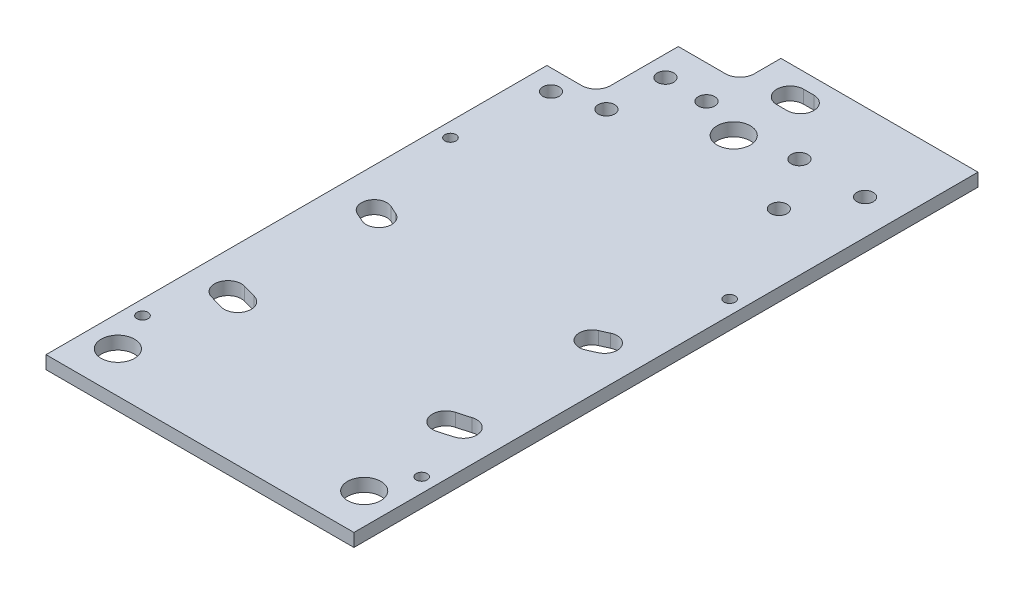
ISO-10303-21;
HEADER;
FILE_DESCRIPTION(('STEP AP214'),'2;1');
FILE_NAME('part.step','',(''),(''),'','','');
FILE_SCHEMA(('AUTOMOTIVE_DESIGN { 1 0 10303 214 1 1 1 1 }'));
ENDSEC;
DATA;
#1=APPLICATION_CONTEXT('core data for automotive mechanical design processes');
#2=APPLICATION_PROTOCOL_DEFINITION('international standard','automotive_design',2000,#1);
#3=PRODUCT_CONTEXT('',#1,'mechanical');
#4=PRODUCT('Part','Part','',(#3));
#5=PRODUCT_RELATED_PRODUCT_CATEGORY('part','',(#4));
#6=PRODUCT_DEFINITION_FORMATION('','',#4);
#7=PRODUCT_DEFINITION_CONTEXT('part definition',#1,'design');
#8=PRODUCT_DEFINITION('design','',#6,#7);
#9=PRODUCT_DEFINITION_SHAPE('','',#8);
#10=(LENGTH_UNIT() NAMED_UNIT(*) SI_UNIT(.MILLI.,.METRE.));
#11=(NAMED_UNIT(*) PLANE_ANGLE_UNIT() SI_UNIT($,.RADIAN.));
#12=(NAMED_UNIT(*) SI_UNIT($,.STERADIAN.) SOLID_ANGLE_UNIT());
#13=UNCERTAINTY_MEASURE_WITH_UNIT(LENGTH_MEASURE(1.E-05),#10,'distance_accuracy_value','');
#14=(GEOMETRIC_REPRESENTATION_CONTEXT(3) GLOBAL_UNCERTAINTY_ASSIGNED_CONTEXT((#13)) GLOBAL_UNIT_ASSIGNED_CONTEXT((#10,
#11,#12)) REPRESENTATION_CONTEXT('',''));
#15=CARTESIAN_POINT('',(0.,0.,0.));
#16=DIRECTION('',(0.,0.,1.));
#17=DIRECTION('',(1.,0.,0.));
#18=AXIS2_PLACEMENT_3D('',#15,#16,#17);
#19=CARTESIAN_POINT('',(37.5,3.175,-76.));
#20=DIRECTION('',(-1.,0.,0.));
#21=DIRECTION('',(0.,0.,1.));
#22=AXIS2_PLACEMENT_3D('',#19,#20,#21);
#23=PLANE('',#22);
#24=DIRECTION('',(0.,0.,-1.));
#25=VECTOR('',#24,1.);
#26=CARTESIAN_POINT('',(37.5,0.,-76.));
#27=LINE('',#26,#25);
#28=CARTESIAN_POINT('',(37.5,0.,76.));
#29=VERTEX_POINT('',#28);
#30=CARTESIAN_POINT('',(37.5,0.,-76.));
#31=VERTEX_POINT('',#30);
#32=EDGE_CURVE('E278',#29,#31,#27,.T.);
#33=ORIENTED_EDGE('',*,*,#32,.T.);
#34=DIRECTION('',(0.,-1.,0.));
#35=VECTOR('',#34,1.);
#36=CARTESIAN_POINT('',(37.5,3.175,-76.));
#37=LINE('',#36,#35);
#38=CARTESIAN_POINT('',(37.5,3.175,-76.));
#39=VERTEX_POINT('',#38);
#40=EDGE_CURVE('E288',#39,#31,#37,.T.);
#41=ORIENTED_EDGE('',*,*,#40,.F.);
#42=DIRECTION('',(0.,0.,-1.));
#43=VECTOR('',#42,1.);
#44=CARTESIAN_POINT('',(37.5,3.175,-76.));
#45=LINE('',#44,#43);
#46=CARTESIAN_POINT('',(37.5,3.175,76.));
#47=VERTEX_POINT('',#46);
#48=EDGE_CURVE('E275',#47,#39,#45,.T.);
#49=ORIENTED_EDGE('',*,*,#48,.F.);
#50=DIRECTION('',(0.,-1.,0.));
#51=VECTOR('',#50,1.);
#52=CARTESIAN_POINT('',(37.5,3.175,76.));
#53=LINE('',#52,#51);
#54=EDGE_CURVE('E282',#47,#29,#53,.T.);
#55=ORIENTED_EDGE('',*,*,#54,.T.);
#56=EDGE_LOOP('',(#33,#41,#49,#55));
#57=FACE_BOUND('',#56,.T.);
#58=ADVANCED_FACE('F51',(#57),#23,.F.);
#59=CARTESIAN_POINT('',(-37.5,3.175,-76.));
#60=DIRECTION('',(0.,0.,1.));
#61=DIRECTION('',(1.,0.,0.));
#62=AXIS2_PLACEMENT_3D('',#59,#60,#61);
#63=PLANE('',#62);
#64=DIRECTION('',(-1.,0.,0.));
#65=VECTOR('',#64,1.);
#66=CARTESIAN_POINT('',(-37.5,0.,-76.));
#67=LINE('',#66,#65);
#68=CARTESIAN_POINT('',(-10.5,0.,-76.));
#69=VERTEX_POINT('',#68);
#70=EDGE_CURVE('E273',#31,#69,#67,.T.);
#71=ORIENTED_EDGE('',*,*,#70,.T.);
#72=DIRECTION('',(0.,1.,0.));
#73=VECTOR('',#72,1.);
#74=CARTESIAN_POINT('',(-10.5,-0.00100000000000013,-76.));
#75=LINE('',#74,#73);
#76=CARTESIAN_POINT('',(-10.5,3.175,-76.));
#77=VERTEX_POINT('',#76);
#78=EDGE_CURVE('E258',#69,#77,#75,.T.);
#79=ORIENTED_EDGE('',*,*,#78,.T.);
#80=DIRECTION('',(-1.,0.,0.));
#81=VECTOR('',#80,1.);
#82=CARTESIAN_POINT('',(-37.5,3.175,-76.));
#83=LINE('',#82,#81);
#84=EDGE_CURVE('E307',#39,#77,#83,.T.);
#85=ORIENTED_EDGE('',*,*,#84,.F.);
#86=ORIENTED_EDGE('',*,*,#40,.T.);
#87=EDGE_LOOP('',(#71,#79,#85,#86));
#88=FACE_BOUND('',#87,.T.);
#89=ADVANCED_FACE('F536',(#88),#63,.F.);
#90=CARTESIAN_POINT('',(-37.5,3.175,-76.));
#91=DIRECTION('',(1.,0.,0.));
#92=DIRECTION('',(0.,0.,-1.));
#93=AXIS2_PLACEMENT_3D('',#90,#91,#92);
#94=PLANE('',#93);
#95=DIRECTION('',(0.,0.,1.));
#96=VECTOR('',#95,1.);
#97=CARTESIAN_POINT('',(-37.5,3.175,-76.));
#98=LINE('',#97,#96);
#99=CARTESIAN_POINT('',(-37.5,3.175,-46.));
#100=VERTEX_POINT('',#99);
#101=CARTESIAN_POINT('',(-37.5,3.175,76.));
#102=VERTEX_POINT('',#101);
#103=EDGE_CURVE('E266',#100,#102,#98,.T.);
#104=ORIENTED_EDGE('',*,*,#103,.F.);
#105=DIRECTION('',(0.,1.,0.));
#106=VECTOR('',#105,1.);
#107=CARTESIAN_POINT('',(-37.5,-0.00100000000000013,-46.));
#108=LINE('',#107,#106);
#109=CARTESIAN_POINT('',(-37.5,0.,-46.));
#110=VERTEX_POINT('',#109);
#111=EDGE_CURVE('E251',#110,#100,#108,.T.);
#112=ORIENTED_EDGE('',*,*,#111,.F.);
#113=DIRECTION('',(0.,0.,1.));
#114=VECTOR('',#113,1.);
#115=CARTESIAN_POINT('',(-37.5,0.,-76.));
#116=LINE('',#115,#114);
#117=CARTESIAN_POINT('',(-37.5,0.,76.));
#118=VERTEX_POINT('',#117);
#119=EDGE_CURVE('E264',#110,#118,#116,.T.);
#120=ORIENTED_EDGE('',*,*,#119,.T.);
#121=DIRECTION('',(0.,-1.,0.));
#122=VECTOR('',#121,1.);
#123=CARTESIAN_POINT('',(-37.5,3.175,76.));
#124=LINE('',#123,#122);
#125=EDGE_CURVE('E285',#102,#118,#124,.T.);
#126=ORIENTED_EDGE('',*,*,#125,.F.);
#127=EDGE_LOOP('',(#104,#112,#120,#126));
#128=FACE_BOUND('',#127,.T.);
#129=ADVANCED_FACE('F262',(#128),#94,.F.);
#130=CARTESIAN_POINT('',(-37.5,3.175,76.));
#131=DIRECTION('',(0.,0.,-1.));
#132=DIRECTION('',(-1.,0.,0.));
#133=AXIS2_PLACEMENT_3D('',#130,#131,#132);
#134=PLANE('',#133);
#135=DIRECTION('',(1.,0.,0.));
#136=VECTOR('',#135,1.);
#137=CARTESIAN_POINT('',(-37.5,0.,76.));
#138=LINE('',#137,#136);
#139=EDGE_CURVE('E272',#118,#29,#138,.T.);
#140=ORIENTED_EDGE('',*,*,#139,.T.);
#141=ORIENTED_EDGE('',*,*,#54,.F.);
#142=DIRECTION('',(1.,0.,0.));
#143=VECTOR('',#142,1.);
#144=CARTESIAN_POINT('',(-37.5,3.175,76.));
#145=LINE('',#144,#143);
#146=EDGE_CURVE('E286',#102,#47,#145,.T.);
#147=ORIENTED_EDGE('',*,*,#146,.F.);
#148=ORIENTED_EDGE('',*,*,#125,.T.);
#149=EDGE_LOOP('',(#140,#141,#147,#148));
#150=FACE_BOUND('',#149,.T.);
#151=ADVANCED_FACE('F539',(#150),#134,.F.);
#152=CARTESIAN_POINT('',(0.,3.175,0.));
#153=DIRECTION('',(0.,1.,0.));
#154=DIRECTION('',(0.,0.,1.));
#155=AXIS2_PLACEMENT_3D('',#152,#153,#154);
#156=PLANE('',#155);
#157=CARTESIAN_POINT('',(-10.5,3.175,-57.875));
#158=DIRECTION('',(0.,1.,0.));
#159=DIRECTION('',(0.,0.,1.));
#160=AXIS2_PLACEMENT_3D('',#157,#158,#159);
#161=CIRCLE('',#160,2.);
#162=CARTESIAN_POINT('',(-10.5,3.175,-55.875));
#163=VERTEX_POINT('',#162);
#164=EDGE_CURVE('E1078',#163,#163,#161,.T.);
#165=ORIENTED_EDGE('',*,*,#164,.F.);
#166=EDGE_LOOP('',(#165));
#167=FACE_BOUND('',#166,.T.);
#168=CARTESIAN_POINT('',(-20.5,3.175,-57.875));
#169=DIRECTION('',(0.,1.,0.));
#170=DIRECTION('',(0.,0.,1.));
#171=AXIS2_PLACEMENT_3D('',#168,#169,#170);
#172=CIRCLE('',#171,2.);
#173=CARTESIAN_POINT('',(-20.5,3.175,-55.875));
#174=VERTEX_POINT('',#173);
#175=EDGE_CURVE('E1082',#174,#174,#172,.T.);
#176=ORIENTED_EDGE('',*,*,#175,.F.);
#177=EDGE_LOOP('',(#176));
#178=FACE_BOUND('',#177,.T.);
#179=CARTESIAN_POINT('',(13.,3.175,-57.));
#180=DIRECTION('',(0.,1.,0.));
#181=DIRECTION('',(0.,0.,1.));
#182=AXIS2_PLACEMENT_3D('',#179,#180,#181);
#183=CIRCLE('',#182,2.);
#184=CARTESIAN_POINT('',(13.,3.175,-55.));
#185=VERTEX_POINT('',#184);
#186=EDGE_CURVE('E1091',#185,#185,#183,.T.);
#187=ORIENTED_EDGE('',*,*,#186,.F.);
#188=EDGE_LOOP('',(#187));
#189=FACE_BOUND('',#188,.T.);
#190=CARTESIAN_POINT('',(29.,3.175,-57.));
#191=DIRECTION('',(0.,1.,0.));
#192=DIRECTION('',(0.,0.,1.));
#193=AXIS2_PLACEMENT_3D('',#190,#191,#192);
#194=CIRCLE('',#193,2.00000000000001);
#195=CARTESIAN_POINT('',(29.,3.175,-55.));
#196=VERTEX_POINT('',#195);
#197=EDGE_CURVE('E1097',#196,#196,#194,.T.);
#198=ORIENTED_EDGE('',*,*,#197,.F.);
#199=EDGE_LOOP('',(#198));
#200=FACE_BOUND('',#199,.T.);
#201=CARTESIAN_POINT('',(21.,3.175,-44.));
#202=DIRECTION('',(0.,1.,0.));
#203=DIRECTION('',(0.,0.,1.));
#204=AXIS2_PLACEMENT_3D('',#201,#202,#203);
#205=CIRCLE('',#204,2.00000000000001);
#206=CARTESIAN_POINT('',(21.,3.175,-42.));
#207=VERTEX_POINT('',#206);
#208=EDGE_CURVE('E1103',#207,#207,#205,.T.);
#209=ORIENTED_EDGE('',*,*,#208,.F.);
#210=EDGE_LOOP('',(#209));
#211=FACE_BOUND('',#210,.T.);
#212=CARTESIAN_POINT('',(-21.,3.175,-44.));
#213=DIRECTION('',(0.,1.,0.));
#214=DIRECTION('',(0.,0.,1.));
#215=AXIS2_PLACEMENT_3D('',#212,#213,#214);
#216=CIRCLE('',#215,2.00000000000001);
#217=CARTESIAN_POINT('',(-21.,3.175,-42.));
#218=VERTEX_POINT('',#217);
#219=EDGE_CURVE('E1109',#218,#218,#216,.T.);
#220=ORIENTED_EDGE('',*,*,#219,.F.);
#221=EDGE_LOOP('',(#220));
#222=FACE_BOUND('',#221,.T.);
#223=DIRECTION('',(0.,0.,-1.));
#224=VECTOR('',#223,1.);
#225=CARTESIAN_POINT('',(-10.5,3.175,-66.));
#226=LINE('',#225,#224);
#227=CARTESIAN_POINT('',(-10.5,3.175,-69.5));
#228=VERTEX_POINT('',#227);
#229=EDGE_CURVE('E267',#228,#77,#226,.T.);
#230=ORIENTED_EDGE('',*,*,#229,.F.);
#231=CARTESIAN_POINT('',(-14.,3.175,-69.5));
#232=DIRECTION('',(0.,1.,0.));
#233=DIRECTION('',(0.,0.,1.));
#234=AXIS2_PLACEMENT_3D('',#231,#232,#233);
#235=CIRCLE('',#234,3.5);
#236=CARTESIAN_POINT('',(-14.,3.175,-66.));
#237=VERTEX_POINT('',#236);
#238=EDGE_CURVE('E59',#228,#237,#235,.F.);
#239=ORIENTED_EDGE('',*,*,#238,.T.);
#240=DIRECTION('',(1.,0.,0.));
#241=VECTOR('',#240,1.);
#242=CARTESIAN_POINT('',(-25.5,3.175,-66.));
#243=LINE('',#242,#241);
#244=CARTESIAN_POINT('',(-25.5,3.175,-66.));
#245=VERTEX_POINT('',#244);
#246=EDGE_CURVE('E308',#245,#237,#243,.T.);
#247=ORIENTED_EDGE('',*,*,#246,.F.);
#248=DIRECTION('',(0.,0.,-1.));
#249=VECTOR('',#248,1.);
#250=CARTESIAN_POINT('',(-25.5,3.175,-66.));
#251=LINE('',#250,#249);
#252=CARTESIAN_POINT('',(-25.5,3.175,-49.5));
#253=VERTEX_POINT('',#252);
#254=EDGE_CURVE('E310',#253,#245,#251,.T.);
#255=ORIENTED_EDGE('',*,*,#254,.F.);
#256=CARTESIAN_POINT('',(-29.,3.175,-49.5));
#257=DIRECTION('',(0.,1.,0.));
#258=DIRECTION('',(0.,0.,1.));
#259=AXIS2_PLACEMENT_3D('',#256,#257,#258);
#260=CIRCLE('',#259,3.5);
#261=CARTESIAN_POINT('',(-29.,3.175,-46.));
#262=VERTEX_POINT('',#261);
#263=EDGE_CURVE('E1125',#262,#253,#260,.T.);
#264=ORIENTED_EDGE('',*,*,#263,.F.);
#265=DIRECTION('',(1.,0.,0.));
#266=VECTOR('',#265,1.);
#267=CARTESIAN_POINT('',(-34.,3.175,-46.));
#268=LINE('',#267,#266);
#269=EDGE_CURVE('E1123',#100,#262,#268,.T.);
#270=ORIENTED_EDGE('',*,*,#269,.F.);
#271=ORIENTED_EDGE('',*,*,#103,.T.);
#272=ORIENTED_EDGE('',*,*,#146,.T.);
#273=ORIENTED_EDGE('',*,*,#48,.T.);
#274=ORIENTED_EDGE('',*,*,#84,.T.);
#275=EDGE_LOOP('',(#230,#239,#247,#255,#264,#270,#271,#272,#273,#274));
#276=FACE_BOUND('',#275,.T.);
#277=CARTESIAN_POINT('',(-31.5,3.175,-41.));
#278=DIRECTION('',(0.,1.,0.));
#279=DIRECTION('',(0.,0.,1.));
#280=AXIS2_PLACEMENT_3D('',#277,#278,#279);
#281=CIRCLE('',#280,2.00000000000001);
#282=CARTESIAN_POINT('',(-31.5,3.175,-39.));
#283=VERTEX_POINT('',#282);
#284=EDGE_CURVE('E257',#283,#283,#281,.T.);
#285=ORIENTED_EDGE('',*,*,#284,.F.);
#286=EDGE_LOOP('',(#285));
#287=FACE_BOUND('',#286,.T.);
#288=CARTESIAN_POINT('',(25.9487433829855,3.175,6.46207668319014));
#289=DIRECTION('',(0.,1.,0.));
#290=DIRECTION('',(0.,0.,1.));
#291=AXIS2_PLACEMENT_3D('',#288,#289,#290);
#292=CIRCLE('',#291,3.10000000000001);
#293=CARTESIAN_POINT('',(24.7261438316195,3.175,3.61334883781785));
#294=VERTEX_POINT('',#293);
#295=CARTESIAN_POINT('',(27.1713429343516,3.175,9.31080452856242));
#296=VERTEX_POINT('',#295);
#297=EDGE_CURVE('E325',#294,#296,#292,.T.);
#298=ORIENTED_EDGE('',*,*,#297,.F.);
#299=CARTESIAN_POINT('',(0.,3.175,-54.));
#300=DIRECTION('',(0.,-1.,0.));
#301=DIRECTION('',(0.,0.,1.));
#302=AXIS2_PLACEMENT_3D('',#299,#300,#301);
#303=CIRCLE('',#302,62.6951365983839);
#304=CARTESIAN_POINT('',(26.7217582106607,3.175,2.71532236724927));
#305=VERTEX_POINT('',#304);
#306=EDGE_CURVE('E330',#305,#294,#303,.T.);
#307=ORIENTED_EDGE('',*,*,#306,.F.);
#308=CARTESIAN_POINT('',(28.0430321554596,3.175,5.51964673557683));
#309=DIRECTION('',(0.,1.,0.));
#310=DIRECTION('',(0.,0.,1.));
#311=AXIS2_PLACEMENT_3D('',#308,#309,#310);
#312=CIRCLE('',#311,3.10000000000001);
#313=CARTESIAN_POINT('',(29.3643061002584,3.175,8.32397110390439));
#314=VERTEX_POINT('',#313);
#315=EDGE_CURVE('E344',#314,#305,#312,.T.);
#316=ORIENTED_EDGE('',*,*,#315,.F.);
#317=CARTESIAN_POINT('',(0.,3.175,-54.));
#318=DIRECTION('',(0.,1.,0.));
#319=DIRECTION('',(0.,0.,1.));
#320=AXIS2_PLACEMENT_3D('',#317,#318,#319);
#321=CIRCLE('',#320,68.8951365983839);
#322=EDGE_CURVE('E341',#296,#314,#321,.T.);
#323=ORIENTED_EDGE('',*,*,#322,.F.);
#324=EDGE_LOOP('',(#298,#307,#316,#323));
#325=FACE_BOUND('',#324,.T.);
#326=CARTESIAN_POINT('',(-28.0430321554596,3.175,5.51964673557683));
#327=DIRECTION('',(0.,1.,0.));
#328=DIRECTION('',(0.,0.,1.));
#329=AXIS2_PLACEMENT_3D('',#326,#327,#328);
#330=CIRCLE('',#329,3.1);
#331=CARTESIAN_POINT('',(-26.7217582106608,3.175,2.71532236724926));
#332=VERTEX_POINT('',#331);
#333=CARTESIAN_POINT('',(-29.3643061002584,3.175,8.32397110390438));
#334=VERTEX_POINT('',#333);
#335=EDGE_CURVE('E351',#332,#334,#330,.T.);
#336=ORIENTED_EDGE('',*,*,#335,.F.);
#337=CARTESIAN_POINT('',(0.,3.175,-54.));
#338=DIRECTION('',(0.,-1.,0.));
#339=DIRECTION('',(0.,0.,1.));
#340=AXIS2_PLACEMENT_3D('',#337,#338,#339);
#341=CIRCLE('',#340,62.6951365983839);
#342=CARTESIAN_POINT('',(-24.7261438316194,3.175,3.61334883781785));
#343=VERTEX_POINT('',#342);
#344=EDGE_CURVE('E362',#343,#332,#341,.T.);
#345=ORIENTED_EDGE('',*,*,#344,.F.);
#346=CARTESIAN_POINT('',(-25.9487433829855,3.175,6.46207668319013));
#347=DIRECTION('',(0.,1.,0.));
#348=DIRECTION('',(0.,0.,1.));
#349=AXIS2_PLACEMENT_3D('',#346,#347,#348);
#350=CIRCLE('',#349,3.1);
#351=CARTESIAN_POINT('',(-27.1713429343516,3.175,9.31080452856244));
#352=VERTEX_POINT('',#351);
#353=EDGE_CURVE('E376',#352,#343,#350,.T.);
#354=ORIENTED_EDGE('',*,*,#353,.F.);
#355=CARTESIAN_POINT('',(0.,3.175,-54.));
#356=DIRECTION('',(0.,1.,0.));
#357=DIRECTION('',(0.,0.,1.));
#358=AXIS2_PLACEMENT_3D('',#355,#356,#357);
#359=CIRCLE('',#358,68.8951365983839);
#360=EDGE_CURVE('E373',#334,#352,#359,.T.);
#361=ORIENTED_EDGE('',*,*,#360,.F.);
#362=EDGE_LOOP('',(#336,#345,#354,#361));
#363=FACE_BOUND('',#362,.T.);
#364=CARTESIAN_POINT('',(-1.25,3.175,-69.));
#365=DIRECTION('',(0.,1.,0.));
#366=DIRECTION('',(0.,0.,1.));
#367=AXIS2_PLACEMENT_3D('',#364,#365,#366);
#368=CIRCLE('',#367,3.26);
#369=CARTESIAN_POINT('',(-1.25,3.175,-72.26));
#370=VERTEX_POINT('',#369);
#371=CARTESIAN_POINT('',(-1.25,3.175,-65.74));
#372=VERTEX_POINT('',#371);
#373=EDGE_CURVE('E383',#370,#372,#368,.T.);
#374=ORIENTED_EDGE('',*,*,#373,.F.);
#375=DIRECTION('',(-1.,0.,0.));
#376=VECTOR('',#375,1.);
#377=CARTESIAN_POINT('',(-1.25,3.175,-72.26));
#378=LINE('',#377,#376);
#379=CARTESIAN_POINT('',(1.25,3.175,-72.26));
#380=VERTEX_POINT('',#379);
#381=EDGE_CURVE('E394',#380,#370,#378,.T.);
#382=ORIENTED_EDGE('',*,*,#381,.F.);
#383=CARTESIAN_POINT('',(1.25,3.175,-69.));
#384=DIRECTION('',(0.,1.,0.));
#385=DIRECTION('',(0.,0.,1.));
#386=AXIS2_PLACEMENT_3D('',#383,#384,#385);
#387=CIRCLE('',#386,3.26);
#388=CARTESIAN_POINT('',(1.25,3.175,-65.74));
#389=VERTEX_POINT('',#388);
#390=EDGE_CURVE('E408',#389,#380,#387,.T.);
#391=ORIENTED_EDGE('',*,*,#390,.F.);
#392=DIRECTION('',(1.,0.,0.));
#393=VECTOR('',#392,1.);
#394=CARTESIAN_POINT('',(-1.25,3.175,-65.74));
#395=LINE('',#394,#393);
#396=EDGE_CURVE('E405',#372,#389,#395,.T.);
#397=ORIENTED_EDGE('',*,*,#396,.F.);
#398=EDGE_LOOP('',(#374,#382,#391,#397));
#399=FACE_BOUND('',#398,.T.);
#400=CARTESIAN_POINT('',(25.3379091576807,3.175,41.4567460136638));
#401=DIRECTION('',(0.,1.,0.));
#402=DIRECTION('',(0.,0.,1.));
#403=AXIS2_PLACEMENT_3D('',#400,#401,#402);
#404=CIRCLE('',#403,3.2639);
#405=CARTESIAN_POINT('',(24.500541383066,3.175,38.3020893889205));
#406=VERTEX_POINT('',#405);
#407=CARTESIAN_POINT('',(26.1752769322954,3.175,44.6114026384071));
#408=VERTEX_POINT('',#407);
#409=EDGE_CURVE('E415',#406,#408,#404,.T.);
#410=ORIENTED_EDGE('',*,*,#409,.F.);
#411=CARTESIAN_POINT('',(0.,3.175,-54.));
#412=DIRECTION('',(0.,-1.,0.));
#413=DIRECTION('',(0.,0.,1.));
#414=AXIS2_PLACEMENT_3D('',#411,#412,#413);
#415=CIRCLE('',#414,95.4984410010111);
#416=CARTESIAN_POINT('',(27.7069127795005,3.175,37.390804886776));
#417=VERTEX_POINT('',#416);
#418=EDGE_CURVE('E426',#417,#406,#415,.T.);
#419=ORIENTED_EDGE('',*,*,#418,.F.);
#420=CARTESIAN_POINT('',(28.6538663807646,3.175,40.5143160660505));
#421=DIRECTION('',(0.,1.,0.));
#422=DIRECTION('',(0.,0.,1.));
#423=AXIS2_PLACEMENT_3D('',#420,#421,#422);
#424=CIRCLE('',#423,3.26389999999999);
#425=CARTESIAN_POINT('',(29.6008199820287,3.175,43.637827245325));
#426=VERTEX_POINT('',#425);
#427=EDGE_CURVE('E440',#426,#417,#424,.T.);
#428=ORIENTED_EDGE('',*,*,#427,.F.);
#429=CARTESIAN_POINT('',(0.,3.175,-54.));
#430=DIRECTION('',(0.,1.,0.));
#431=DIRECTION('',(0.,0.,1.));
#432=AXIS2_PLACEMENT_3D('',#429,#430,#431);
#433=CIRCLE('',#432,102.026241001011);
#434=EDGE_CURVE('E437',#408,#426,#433,.T.);
#435=ORIENTED_EDGE('',*,*,#434,.F.);
#436=EDGE_LOOP('',(#410,#419,#428,#435));
#437=FACE_BOUND('',#436,.T.);
#438=CARTESIAN_POINT('',(-28.6538663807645,3.175,40.5143160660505));
#439=DIRECTION('',(0.,1.,0.));
#440=DIRECTION('',(0.,0.,1.));
#441=AXIS2_PLACEMENT_3D('',#438,#439,#440);
#442=CIRCLE('',#441,3.2639);
#443=CARTESIAN_POINT('',(-27.7069127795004,3.175,37.390804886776));
#444=VERTEX_POINT('',#443);
#445=CARTESIAN_POINT('',(-29.6008199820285,3.175,43.6378272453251));
#446=VERTEX_POINT('',#445);
#447=EDGE_CURVE('E447',#444,#446,#442,.T.);
#448=ORIENTED_EDGE('',*,*,#447,.F.);
#449=CARTESIAN_POINT('',(0.,3.175,-54.));
#450=DIRECTION('',(0.,-1.,0.));
#451=DIRECTION('',(0.,0.,1.));
#452=AXIS2_PLACEMENT_3D('',#449,#450,#451);
#453=CIRCLE('',#452,95.4984410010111);
#454=CARTESIAN_POINT('',(-24.5005413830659,3.175,38.3020893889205));
#455=VERTEX_POINT('',#454);
#456=EDGE_CURVE('E458',#455,#444,#453,.T.);
#457=ORIENTED_EDGE('',*,*,#456,.F.);
#458=CARTESIAN_POINT('',(-25.3379091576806,3.175,41.4567460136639));
#459=DIRECTION('',(0.,1.,0.));
#460=DIRECTION('',(0.,0.,1.));
#461=AXIS2_PLACEMENT_3D('',#458,#459,#460);
#462=CIRCLE('',#461,3.2639);
#463=CARTESIAN_POINT('',(-26.1752769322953,3.175,44.6114026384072));
#464=VERTEX_POINT('',#463);
#465=EDGE_CURVE('E472',#464,#455,#462,.T.);
#466=ORIENTED_EDGE('',*,*,#465,.F.);
#467=CARTESIAN_POINT('',(0.,3.175,-54.));
#468=DIRECTION('',(0.,1.,0.));
#469=DIRECTION('',(0.,0.,1.));
#470=AXIS2_PLACEMENT_3D('',#467,#468,#469);
#471=CIRCLE('',#470,102.026241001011);
#472=EDGE_CURVE('E469',#446,#464,#471,.T.);
#473=ORIENTED_EDGE('',*,*,#472,.F.);
#474=EDGE_LOOP('',(#448,#457,#466,#473));
#475=FACE_BOUND('',#474,.T.);
#476=CARTESIAN_POINT('',(-34.0000000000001,3.175,-19.));
#477=DIRECTION('',(0.,1.,0.));
#478=DIRECTION('',(0.,0.,1.));
#479=AXIS2_PLACEMENT_3D('',#476,#477,#478);
#480=CIRCLE('',#479,1.35254999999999);
#481=CARTESIAN_POINT('',(-34.0000000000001,3.175,-17.64745));
#482=VERTEX_POINT('',#481);
#483=EDGE_CURVE('E479',#482,#482,#480,.T.);
#484=ORIENTED_EDGE('',*,*,#483,.F.);
#485=EDGE_LOOP('',(#484));
#486=FACE_BOUND('',#485,.T.);
#487=CARTESIAN_POINT('',(33.9999999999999,3.175,-19.));
#488=DIRECTION('',(0.,1.,0.));
#489=DIRECTION('',(0.,0.,1.));
#490=AXIS2_PLACEMENT_3D('',#487,#488,#489);
#491=CIRCLE('',#490,1.35254999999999);
#492=CARTESIAN_POINT('',(33.9999999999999,3.175,-17.64745));
#493=VERTEX_POINT('',#492);
#494=EDGE_CURVE('E491',#493,#493,#491,.T.);
#495=ORIENTED_EDGE('',*,*,#494,.F.);
#496=EDGE_LOOP('',(#495));
#497=FACE_BOUND('',#496,.T.);
#498=CARTESIAN_POINT('',(-34.0000000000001,3.175,56.));
#499=DIRECTION('',(0.,1.,0.));
#500=DIRECTION('',(0.,0.,1.));
#501=AXIS2_PLACEMENT_3D('',#498,#499,#500);
#502=CIRCLE('',#501,1.35254999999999);
#503=CARTESIAN_POINT('',(-34.0000000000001,3.175,57.35255));
#504=VERTEX_POINT('',#503);
#505=EDGE_CURVE('E497',#504,#504,#502,.T.);
#506=ORIENTED_EDGE('',*,*,#505,.F.);
#507=EDGE_LOOP('',(#506));
#508=FACE_BOUND('',#507,.T.);
#509=CARTESIAN_POINT('',(34.,3.175,56.));
#510=DIRECTION('',(0.,1.,0.));
#511=DIRECTION('',(0.,0.,1.));
#512=AXIS2_PLACEMENT_3D('',#509,#510,#511);
#513=CIRCLE('',#512,1.35254999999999);
#514=CARTESIAN_POINT('',(34.,3.175,57.35255));
#515=VERTEX_POINT('',#514);
#516=EDGE_CURVE('E503',#515,#515,#513,.T.);
#517=ORIENTED_EDGE('',*,*,#516,.F.);
#518=EDGE_LOOP('',(#517));
#519=FACE_BOUND('',#518,.T.);
#520=CARTESIAN_POINT('',(-30.,3.175,66.));
#521=DIRECTION('',(0.,1.,0.));
#522=DIRECTION('',(0.,0.,1.));
#523=AXIS2_PLACEMENT_3D('',#520,#521,#522);
#524=CIRCLE('',#523,4.0625);
#525=CARTESIAN_POINT('',(-30.,3.175,70.0625));
#526=VERTEX_POINT('',#525);
#527=EDGE_CURVE('E509',#526,#526,#524,.T.);
#528=ORIENTED_EDGE('',*,*,#527,.F.);
#529=EDGE_LOOP('',(#528));
#530=FACE_BOUND('',#529,.T.);
#531=CARTESIAN_POINT('',(30.,3.175,66.));
#532=DIRECTION('',(0.,1.,0.));
#533=DIRECTION('',(0.,0.,1.));
#534=AXIS2_PLACEMENT_3D('',#531,#532,#533);
#535=CIRCLE('',#534,4.0625);
#536=CARTESIAN_POINT('',(30.,3.175,70.0625));
#537=VERTEX_POINT('',#536);
#538=EDGE_CURVE('E513',#537,#537,#535,.T.);
#539=ORIENTED_EDGE('',*,*,#538,.F.);
#540=EDGE_LOOP('',(#539));
#541=FACE_BOUND('',#540,.T.);
#542=CARTESIAN_POINT('',(0.,3.175,-54.));
#543=DIRECTION('',(0.,1.,0.));
#544=DIRECTION('',(0.,0.,1.));
#545=AXIS2_PLACEMENT_3D('',#542,#543,#544);
#546=CIRCLE('',#545,4.0625);
#547=CARTESIAN_POINT('',(0.,3.175,-49.9375));
#548=VERTEX_POINT('',#547);
#549=EDGE_CURVE('E519',#548,#548,#546,.T.);
#550=ORIENTED_EDGE('',*,*,#549,.F.);
#551=EDGE_LOOP('',(#550));
#552=FACE_BOUND('',#551,.T.);
#553=ADVANCED_FACE('F304',(#167,#178,#189,#200,#211,#222,#276,#287,#325,#363,#399,#437,#475,
#486,#497,#508,#519,#530,#541,#552),#156,.T.);
#554=CARTESIAN_POINT('',(0.,0.,0.));
#555=DIRECTION('',(0.,1.,0.));
#556=DIRECTION('',(0.,0.,1.));
#557=AXIS2_PLACEMENT_3D('',#554,#555,#556);
#558=PLANE('',#557);
#559=CARTESIAN_POINT('',(-10.5,0.,-57.875));
#560=DIRECTION('',(0.,1.,0.));
#561=DIRECTION('',(0.,0.,1.));
#562=AXIS2_PLACEMENT_3D('',#559,#560,#561);
#563=CIRCLE('',#562,2.);
#564=CARTESIAN_POINT('',(-10.5,0.,-55.875));
#565=VERTEX_POINT('',#564);
#566=EDGE_CURVE('E1081',#565,#565,#563,.F.);
#567=ORIENTED_EDGE('',*,*,#566,.F.);
#568=EDGE_LOOP('',(#567));
#569=FACE_BOUND('',#568,.T.);
#570=CARTESIAN_POINT('',(-20.5,0.,-57.875));
#571=DIRECTION('',(0.,1.,0.));
#572=DIRECTION('',(0.,0.,1.));
#573=AXIS2_PLACEMENT_3D('',#570,#571,#572);
#574=CIRCLE('',#573,2.);
#575=CARTESIAN_POINT('',(-20.5,0.,-55.875));
#576=VERTEX_POINT('',#575);
#577=EDGE_CURVE('E1085',#576,#576,#574,.F.);
#578=ORIENTED_EDGE('',*,*,#577,.F.);
#579=EDGE_LOOP('',(#578));
#580=FACE_BOUND('',#579,.T.);
#581=CARTESIAN_POINT('',(13.,0.,-57.));
#582=DIRECTION('',(0.,1.,0.));
#583=DIRECTION('',(0.,0.,1.));
#584=AXIS2_PLACEMENT_3D('',#581,#582,#583);
#585=CIRCLE('',#584,2.);
#586=CARTESIAN_POINT('',(13.,0.,-55.));
#587=VERTEX_POINT('',#586);
#588=EDGE_CURVE('E1094',#587,#587,#585,.F.);
#589=ORIENTED_EDGE('',*,*,#588,.F.);
#590=EDGE_LOOP('',(#589));
#591=FACE_BOUND('',#590,.T.);
#592=CARTESIAN_POINT('',(29.,0.,-57.));
#593=DIRECTION('',(0.,1.,0.));
#594=DIRECTION('',(0.,0.,1.));
#595=AXIS2_PLACEMENT_3D('',#592,#593,#594);
#596=CIRCLE('',#595,2.00000000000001);
#597=CARTESIAN_POINT('',(29.,0.,-55.));
#598=VERTEX_POINT('',#597);
#599=EDGE_CURVE('E1100',#598,#598,#596,.F.);
#600=ORIENTED_EDGE('',*,*,#599,.F.);
#601=EDGE_LOOP('',(#600));
#602=FACE_BOUND('',#601,.T.);
#603=CARTESIAN_POINT('',(21.,0.,-44.));
#604=DIRECTION('',(0.,1.,0.));
#605=DIRECTION('',(0.,0.,1.));
#606=AXIS2_PLACEMENT_3D('',#603,#604,#605);
#607=CIRCLE('',#606,2.00000000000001);
#608=CARTESIAN_POINT('',(21.,0.,-42.));
#609=VERTEX_POINT('',#608);
#610=EDGE_CURVE('E1106',#609,#609,#607,.F.);
#611=ORIENTED_EDGE('',*,*,#610,.F.);
#612=EDGE_LOOP('',(#611));
#613=FACE_BOUND('',#612,.T.);
#614=CARTESIAN_POINT('',(-21.,0.,-44.));
#615=DIRECTION('',(0.,1.,0.));
#616=DIRECTION('',(0.,0.,1.));
#617=AXIS2_PLACEMENT_3D('',#614,#615,#616);
#618=CIRCLE('',#617,2.00000000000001);
#619=CARTESIAN_POINT('',(-21.,0.,-42.));
#620=VERTEX_POINT('',#619);
#621=EDGE_CURVE('E1112',#620,#620,#618,.F.);
#622=ORIENTED_EDGE('',*,*,#621,.F.);
#623=EDGE_LOOP('',(#622));
#624=FACE_BOUND('',#623,.T.);
#625=CARTESIAN_POINT('',(-31.5,0.,-41.));
#626=DIRECTION('',(0.,1.,0.));
#627=DIRECTION('',(0.,0.,1.));
#628=AXIS2_PLACEMENT_3D('',#625,#626,#627);
#629=CIRCLE('',#628,2.00000000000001);
#630=CARTESIAN_POINT('',(-31.5,0.,-39.));
#631=VERTEX_POINT('',#630);
#632=EDGE_CURVE('E322',#631,#631,#629,.F.);
#633=ORIENTED_EDGE('',*,*,#632,.F.);
#634=EDGE_LOOP('',(#633));
#635=FACE_BOUND('',#634,.T.);
#636=CARTESIAN_POINT('',(0.,0.,-54.));
#637=DIRECTION('',(0.,-1.,0.));
#638=DIRECTION('',(0.,0.,1.));
#639=AXIS2_PLACEMENT_3D('',#636,#637,#638);
#640=CIRCLE('',#639,62.6951365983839);
#641=CARTESIAN_POINT('',(26.7217582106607,0.,2.71532236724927));
#642=VERTEX_POINT('',#641);
#643=CARTESIAN_POINT('',(24.7261438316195,0.,3.61334883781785));
#644=VERTEX_POINT('',#643);
#645=EDGE_CURVE('E336',#642,#644,#640,.T.);
#646=ORIENTED_EDGE('',*,*,#645,.T.);
#647=CARTESIAN_POINT('',(25.9487433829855,0.,6.46207668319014));
#648=DIRECTION('',(0.,1.,0.));
#649=DIRECTION('',(0.,0.,1.));
#650=AXIS2_PLACEMENT_3D('',#647,#648,#649);
#651=CIRCLE('',#650,3.10000000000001);
#652=CARTESIAN_POINT('',(27.1713429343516,0.,9.31080452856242));
#653=VERTEX_POINT('',#652);
#654=EDGE_CURVE('E326',#644,#653,#651,.T.);
#655=ORIENTED_EDGE('',*,*,#654,.T.);
#656=CARTESIAN_POINT('',(0.,0.,-54.));
#657=DIRECTION('',(0.,1.,0.));
#658=DIRECTION('',(0.,0.,1.));
#659=AXIS2_PLACEMENT_3D('',#656,#657,#658);
#660=CIRCLE('',#659,68.8951365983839);
#661=CARTESIAN_POINT('',(29.3643061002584,0.,8.32397110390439));
#662=VERTEX_POINT('',#661);
#663=EDGE_CURVE('E329',#653,#662,#660,.T.);
#664=ORIENTED_EDGE('',*,*,#663,.T.);
#665=CARTESIAN_POINT('',(28.0430321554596,0.,5.51964673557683));
#666=DIRECTION('',(0.,1.,0.));
#667=DIRECTION('',(0.,0.,1.));
#668=AXIS2_PLACEMENT_3D('',#665,#666,#667);
#669=CIRCLE('',#668,3.10000000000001);
#670=EDGE_CURVE('E333',#662,#642,#669,.T.);
#671=ORIENTED_EDGE('',*,*,#670,.T.);
#672=EDGE_LOOP('',(#646,#655,#664,#671));
#673=FACE_BOUND('',#672,.T.);
#674=CARTESIAN_POINT('',(0.,0.,-54.));
#675=DIRECTION('',(0.,-1.,0.));
#676=DIRECTION('',(0.,0.,1.));
#677=AXIS2_PLACEMENT_3D('',#674,#675,#676);
#678=CIRCLE('',#677,62.6951365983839);
#679=CARTESIAN_POINT('',(-24.7261438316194,0.,3.61334883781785));
#680=VERTEX_POINT('',#679);
#681=CARTESIAN_POINT('',(-26.7217582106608,0.,2.71532236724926));
#682=VERTEX_POINT('',#681);
#683=EDGE_CURVE('E368',#680,#682,#678,.T.);
#684=ORIENTED_EDGE('',*,*,#683,.T.);
#685=CARTESIAN_POINT('',(-28.0430321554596,0.,5.51964673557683));
#686=DIRECTION('',(0.,1.,0.));
#687=DIRECTION('',(0.,0.,1.));
#688=AXIS2_PLACEMENT_3D('',#685,#686,#687);
#689=CIRCLE('',#688,3.1);
#690=CARTESIAN_POINT('',(-29.3643061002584,0.,8.32397110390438));
#691=VERTEX_POINT('',#690);
#692=EDGE_CURVE('E358',#682,#691,#689,.T.);
#693=ORIENTED_EDGE('',*,*,#692,.T.);
#694=CARTESIAN_POINT('',(0.,0.,-54.));
#695=DIRECTION('',(0.,1.,0.));
#696=DIRECTION('',(0.,0.,1.));
#697=AXIS2_PLACEMENT_3D('',#694,#695,#696);
#698=CIRCLE('',#697,68.8951365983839);
#699=CARTESIAN_POINT('',(-27.1713429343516,0.,9.31080452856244));
#700=VERTEX_POINT('',#699);
#701=EDGE_CURVE('E361',#691,#700,#698,.T.);
#702=ORIENTED_EDGE('',*,*,#701,.T.);
#703=CARTESIAN_POINT('',(-25.9487433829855,0.,6.46207668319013));
#704=DIRECTION('',(0.,1.,0.));
#705=DIRECTION('',(0.,0.,1.));
#706=AXIS2_PLACEMENT_3D('',#703,#704,#705);
#707=CIRCLE('',#706,3.1);
#708=EDGE_CURVE('E365',#700,#680,#707,.T.);
#709=ORIENTED_EDGE('',*,*,#708,.T.);
#710=EDGE_LOOP('',(#684,#693,#702,#709));
#711=FACE_BOUND('',#710,.T.);
#712=DIRECTION('',(-1.,0.,0.));
#713=VECTOR('',#712,1.);
#714=CARTESIAN_POINT('',(-1.25,0.,-72.26));
#715=LINE('',#714,#713);
#716=CARTESIAN_POINT('',(1.25,0.,-72.26));
#717=VERTEX_POINT('',#716);
#718=CARTESIAN_POINT('',(-1.25,0.,-72.26));
#719=VERTEX_POINT('',#718);
#720=EDGE_CURVE('E400',#717,#719,#715,.T.);
#721=ORIENTED_EDGE('',*,*,#720,.T.);
#722=CARTESIAN_POINT('',(-1.25,0.,-69.));
#723=DIRECTION('',(0.,1.,0.));
#724=DIRECTION('',(0.,0.,1.));
#725=AXIS2_PLACEMENT_3D('',#722,#723,#724);
#726=CIRCLE('',#725,3.26);
#727=CARTESIAN_POINT('',(-1.25,0.,-65.74));
#728=VERTEX_POINT('',#727);
#729=EDGE_CURVE('E390',#719,#728,#726,.T.);
#730=ORIENTED_EDGE('',*,*,#729,.T.);
#731=DIRECTION('',(1.,0.,0.));
#732=VECTOR('',#731,1.);
#733=CARTESIAN_POINT('',(-1.25,0.,-65.74));
#734=LINE('',#733,#732);
#735=CARTESIAN_POINT('',(1.25,0.,-65.74));
#736=VERTEX_POINT('',#735);
#737=EDGE_CURVE('E393',#728,#736,#734,.T.);
#738=ORIENTED_EDGE('',*,*,#737,.T.);
#739=CARTESIAN_POINT('',(1.25,0.,-69.));
#740=DIRECTION('',(0.,1.,0.));
#741=DIRECTION('',(0.,0.,1.));
#742=AXIS2_PLACEMENT_3D('',#739,#740,#741);
#743=CIRCLE('',#742,3.26);
#744=EDGE_CURVE('E397',#736,#717,#743,.T.);
#745=ORIENTED_EDGE('',*,*,#744,.T.);
#746=EDGE_LOOP('',(#721,#730,#738,#745));
#747=FACE_BOUND('',#746,.T.);
#748=CARTESIAN_POINT('',(0.,0.,-54.));
#749=DIRECTION('',(0.,-1.,0.));
#750=DIRECTION('',(0.,0.,1.));
#751=AXIS2_PLACEMENT_3D('',#748,#749,#750);
#752=CIRCLE('',#751,95.4984410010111);
#753=CARTESIAN_POINT('',(27.7069127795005,0.,37.390804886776));
#754=VERTEX_POINT('',#753);
#755=CARTESIAN_POINT('',(24.500541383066,0.,38.3020893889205));
#756=VERTEX_POINT('',#755);
#757=EDGE_CURVE('E432',#754,#756,#752,.T.);
#758=ORIENTED_EDGE('',*,*,#757,.T.);
#759=CARTESIAN_POINT('',(25.3379091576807,0.,41.4567460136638));
#760=DIRECTION('',(0.,1.,0.));
#761=DIRECTION('',(0.,0.,1.));
#762=AXIS2_PLACEMENT_3D('',#759,#760,#761);
#763=CIRCLE('',#762,3.2639);
#764=CARTESIAN_POINT('',(26.1752769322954,0.,44.6114026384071));
#765=VERTEX_POINT('',#764);
#766=EDGE_CURVE('E422',#756,#765,#763,.T.);
#767=ORIENTED_EDGE('',*,*,#766,.T.);
#768=CARTESIAN_POINT('',(0.,0.,-54.));
#769=DIRECTION('',(0.,1.,0.));
#770=DIRECTION('',(0.,0.,1.));
#771=AXIS2_PLACEMENT_3D('',#768,#769,#770);
#772=CIRCLE('',#771,102.026241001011);
#773=CARTESIAN_POINT('',(29.6008199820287,0.,43.637827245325));
#774=VERTEX_POINT('',#773);
#775=EDGE_CURVE('E425',#765,#774,#772,.T.);
#776=ORIENTED_EDGE('',*,*,#775,.T.);
#777=CARTESIAN_POINT('',(28.6538663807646,0.,40.5143160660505));
#778=DIRECTION('',(0.,1.,0.));
#779=DIRECTION('',(0.,0.,1.));
#780=AXIS2_PLACEMENT_3D('',#777,#778,#779);
#781=CIRCLE('',#780,3.26389999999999);
#782=EDGE_CURVE('E429',#774,#754,#781,.T.);
#783=ORIENTED_EDGE('',*,*,#782,.T.);
#784=EDGE_LOOP('',(#758,#767,#776,#783));
#785=FACE_BOUND('',#784,.T.);
#786=CARTESIAN_POINT('',(0.,0.,-54.));
#787=DIRECTION('',(0.,-1.,0.));
#788=DIRECTION('',(0.,0.,1.));
#789=AXIS2_PLACEMENT_3D('',#786,#787,#788);
#790=CIRCLE('',#789,95.4984410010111);
#791=CARTESIAN_POINT('',(-24.5005413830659,0.,38.3020893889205));
#792=VERTEX_POINT('',#791);
#793=CARTESIAN_POINT('',(-27.7069127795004,0.,37.390804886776));
#794=VERTEX_POINT('',#793);
#795=EDGE_CURVE('E464',#792,#794,#790,.T.);
#796=ORIENTED_EDGE('',*,*,#795,.T.);
#797=CARTESIAN_POINT('',(-28.6538663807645,0.,40.5143160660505));
#798=DIRECTION('',(0.,1.,0.));
#799=DIRECTION('',(0.,0.,1.));
#800=AXIS2_PLACEMENT_3D('',#797,#798,#799);
#801=CIRCLE('',#800,3.2639);
#802=CARTESIAN_POINT('',(-29.6008199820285,0.,43.6378272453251));
#803=VERTEX_POINT('',#802);
#804=EDGE_CURVE('E454',#794,#803,#801,.T.);
#805=ORIENTED_EDGE('',*,*,#804,.T.);
#806=CARTESIAN_POINT('',(0.,0.,-54.));
#807=DIRECTION('',(0.,1.,0.));
#808=DIRECTION('',(0.,0.,1.));
#809=AXIS2_PLACEMENT_3D('',#806,#807,#808);
#810=CIRCLE('',#809,102.026241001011);
#811=CARTESIAN_POINT('',(-26.1752769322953,0.,44.6114026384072));
#812=VERTEX_POINT('',#811);
#813=EDGE_CURVE('E457',#803,#812,#810,.T.);
#814=ORIENTED_EDGE('',*,*,#813,.T.);
#815=CARTESIAN_POINT('',(-25.3379091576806,0.,41.4567460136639));
#816=DIRECTION('',(0.,1.,0.));
#817=DIRECTION('',(0.,0.,1.));
#818=AXIS2_PLACEMENT_3D('',#815,#816,#817);
#819=CIRCLE('',#818,3.2639);
#820=EDGE_CURVE('E461',#812,#792,#819,.T.);
#821=ORIENTED_EDGE('',*,*,#820,.T.);
#822=EDGE_LOOP('',(#796,#805,#814,#821));
#823=FACE_BOUND('',#822,.T.);
#824=CARTESIAN_POINT('',(-34.0000000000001,0.,-19.));
#825=DIRECTION('',(0.,1.,0.));
#826=DIRECTION('',(0.,0.,1.));
#827=AXIS2_PLACEMENT_3D('',#824,#825,#826);
#828=CIRCLE('',#827,1.35255);
#829=CARTESIAN_POINT('',(-34.0000000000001,0.,-17.64745));
#830=VERTEX_POINT('',#829);
#831=EDGE_CURVE('E488',#830,#830,#828,.T.);
#832=ORIENTED_EDGE('',*,*,#831,.T.);
#833=EDGE_LOOP('',(#832));
#834=FACE_BOUND('',#833,.T.);
#835=CARTESIAN_POINT('',(33.9999999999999,0.,-19.));
#836=DIRECTION('',(0.,1.,0.));
#837=DIRECTION('',(0.,0.,1.));
#838=AXIS2_PLACEMENT_3D('',#835,#836,#837);
#839=CIRCLE('',#838,1.35255);
#840=CARTESIAN_POINT('',(33.9999999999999,0.,-17.64745));
#841=VERTEX_POINT('',#840);
#842=EDGE_CURVE('E494',#841,#841,#839,.T.);
#843=ORIENTED_EDGE('',*,*,#842,.T.);
#844=EDGE_LOOP('',(#843));
#845=FACE_BOUND('',#844,.T.);
#846=CARTESIAN_POINT('',(-34.0000000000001,0.,56.));
#847=DIRECTION('',(0.,1.,0.));
#848=DIRECTION('',(0.,0.,1.));
#849=AXIS2_PLACEMENT_3D('',#846,#847,#848);
#850=CIRCLE('',#849,1.35255);
#851=CARTESIAN_POINT('',(-34.0000000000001,0.,57.35255));
#852=VERTEX_POINT('',#851);
#853=EDGE_CURVE('E500',#852,#852,#850,.T.);
#854=ORIENTED_EDGE('',*,*,#853,.T.);
#855=EDGE_LOOP('',(#854));
#856=FACE_BOUND('',#855,.T.);
#857=CARTESIAN_POINT('',(34.,0.,56.));
#858=DIRECTION('',(0.,1.,0.));
#859=DIRECTION('',(0.,0.,1.));
#860=AXIS2_PLACEMENT_3D('',#857,#858,#859);
#861=CIRCLE('',#860,1.35255);
#862=CARTESIAN_POINT('',(34.,0.,57.35255));
#863=VERTEX_POINT('',#862);
#864=EDGE_CURVE('E506',#863,#863,#861,.T.);
#865=ORIENTED_EDGE('',*,*,#864,.T.);
#866=EDGE_LOOP('',(#865));
#867=FACE_BOUND('',#866,.T.);
#868=CARTESIAN_POINT('',(-30.,0.,66.));
#869=DIRECTION('',(0.,1.,0.));
#870=DIRECTION('',(0.,0.,1.));
#871=AXIS2_PLACEMENT_3D('',#868,#869,#870);
#872=CIRCLE('',#871,4.0625);
#873=CARTESIAN_POINT('',(-30.,0.,70.0625));
#874=VERTEX_POINT('',#873);
#875=EDGE_CURVE('E510',#874,#874,#872,.T.);
#876=ORIENTED_EDGE('',*,*,#875,.T.);
#877=EDGE_LOOP('',(#876));
#878=FACE_BOUND('',#877,.T.);
#879=CARTESIAN_POINT('',(30.,0.,66.));
#880=DIRECTION('',(0.,1.,0.));
#881=DIRECTION('',(0.,0.,1.));
#882=AXIS2_PLACEMENT_3D('',#879,#880,#881);
#883=CIRCLE('',#882,4.0625);
#884=CARTESIAN_POINT('',(30.,0.,70.0625));
#885=VERTEX_POINT('',#884);
#886=EDGE_CURVE('E516',#885,#885,#883,.T.);
#887=ORIENTED_EDGE('',*,*,#886,.T.);
#888=EDGE_LOOP('',(#887));
#889=FACE_BOUND('',#888,.T.);
#890=CARTESIAN_POINT('',(0.,0.,-54.));
#891=DIRECTION('',(0.,1.,0.));
#892=DIRECTION('',(0.,0.,1.));
#893=AXIS2_PLACEMENT_3D('',#890,#891,#892);
#894=CIRCLE('',#893,4.0625);
#895=CARTESIAN_POINT('',(0.,0.,-49.9375));
#896=VERTEX_POINT('',#895);
#897=EDGE_CURVE('E522',#896,#896,#894,.T.);
#898=ORIENTED_EDGE('',*,*,#897,.T.);
#899=EDGE_LOOP('',(#898));
#900=FACE_BOUND('',#899,.T.);
#901=DIRECTION('',(-1.,0.,0.));
#902=VECTOR('',#901,1.);
#903=CARTESIAN_POINT('',(-25.5,0.,-66.));
#904=LINE('',#903,#902);
#905=CARTESIAN_POINT('',(-14.,0.,-66.));
#906=VERTEX_POINT('',#905);
#907=CARTESIAN_POINT('',(-25.5,0.,-66.));
#908=VERTEX_POINT('',#907);
#909=EDGE_CURVE('E1120',#906,#908,#904,.T.);
#910=ORIENTED_EDGE('',*,*,#909,.F.);
#911=CARTESIAN_POINT('',(-14.,0.,-69.5));
#912=DIRECTION('',(0.,1.,0.));
#913=DIRECTION('',(0.,0.,1.));
#914=AXIS2_PLACEMENT_3D('',#911,#912,#913);
#915=CIRCLE('',#914,3.5);
#916=CARTESIAN_POINT('',(-10.5,0.,-69.5));
#917=VERTEX_POINT('',#916);
#918=EDGE_CURVE('E13',#906,#917,#915,.T.);
#919=ORIENTED_EDGE('',*,*,#918,.T.);
#920=DIRECTION('',(0.,0.,1.));
#921=VECTOR('',#920,1.);
#922=CARTESIAN_POINT('',(-10.5,0.,-66.));
#923=LINE('',#922,#921);
#924=EDGE_CURVE('E300',#69,#917,#923,.T.);
#925=ORIENTED_EDGE('',*,*,#924,.F.);
#926=ORIENTED_EDGE('',*,*,#70,.F.);
#927=ORIENTED_EDGE('',*,*,#32,.F.);
#928=ORIENTED_EDGE('',*,*,#139,.F.);
#929=ORIENTED_EDGE('',*,*,#119,.F.);
#930=DIRECTION('',(-1.,0.,0.));
#931=VECTOR('',#930,1.);
#932=CARTESIAN_POINT('',(-34.,0.,-46.));
#933=LINE('',#932,#931);
#934=CARTESIAN_POINT('',(-29.,0.,-46.));
#935=VERTEX_POINT('',#934);
#936=EDGE_CURVE('E247',#935,#110,#933,.T.);
#937=ORIENTED_EDGE('',*,*,#936,.F.);
#938=CARTESIAN_POINT('',(-29.,0.,-49.5));
#939=DIRECTION('',(0.,1.,0.));
#940=DIRECTION('',(0.,0.,1.));
#941=AXIS2_PLACEMENT_3D('',#938,#939,#940);
#942=CIRCLE('',#941,3.5);
#943=CARTESIAN_POINT('',(-25.5,0.,-49.5));
#944=VERTEX_POINT('',#943);
#945=EDGE_CURVE('E1115',#944,#935,#942,.F.);
#946=ORIENTED_EDGE('',*,*,#945,.F.);
#947=DIRECTION('',(0.,0.,1.));
#948=VECTOR('',#947,1.);
#949=CARTESIAN_POINT('',(-25.5,0.,-66.));
#950=LINE('',#949,#948);
#951=EDGE_CURVE('E1117',#908,#944,#950,.T.);
#952=ORIENTED_EDGE('',*,*,#951,.F.);
#953=EDGE_LOOP('',(#910,#919,#925,#926,#927,#928,#929,#937,#946,#952));
#954=FACE_BOUND('',#953,.T.);
#955=ADVANCED_FACE('F270',(#569,#580,#591,#602,#613,#624,#635,#673,#711,#747,#785,#823,#834,
#845,#856,#867,#878,#889,#900,#954),#558,.F.);
#956=CARTESIAN_POINT('',(0.,0.,-54.));
#957=DIRECTION('',(0.,1.,0.));
#958=DIRECTION('',(0.,0.,1.));
#959=AXIS2_PLACEMENT_3D('',#956,#957,#958);
#960=CYLINDRICAL_SURFACE('',#959,4.0625);
#961=ORIENTED_EDGE('',*,*,#897,.F.);
#962=EDGE_LOOP('',(#961));
#963=FACE_BOUND('',#962,.T.);
#964=ORIENTED_EDGE('',*,*,#549,.T.);
#965=EDGE_LOOP('',(#964));
#966=FACE_BOUND('',#965,.T.);
#967=ADVANCED_FACE('F687',(#963,#966),#960,.F.);
#968=CARTESIAN_POINT('',(30.,0.,66.));
#969=DIRECTION('',(0.,1.,0.));
#970=DIRECTION('',(0.,0.,1.));
#971=AXIS2_PLACEMENT_3D('',#968,#969,#970);
#972=CYLINDRICAL_SURFACE('',#971,4.0625);
#973=ORIENTED_EDGE('',*,*,#886,.F.);
#974=EDGE_LOOP('',(#973));
#975=FACE_BOUND('',#974,.T.);
#976=ORIENTED_EDGE('',*,*,#538,.T.);
#977=EDGE_LOOP('',(#976));
#978=FACE_BOUND('',#977,.T.);
#979=ADVANCED_FACE('F810',(#975,#978),#972,.F.);
#980=CARTESIAN_POINT('',(-30.,0.,66.));
#981=DIRECTION('',(0.,1.,0.));
#982=DIRECTION('',(0.,0.,1.));
#983=AXIS2_PLACEMENT_3D('',#980,#981,#982);
#984=CYLINDRICAL_SURFACE('',#983,4.0625);
#985=ORIENTED_EDGE('',*,*,#875,.F.);
#986=EDGE_LOOP('',(#985));
#987=FACE_BOUND('',#986,.T.);
#988=ORIENTED_EDGE('',*,*,#527,.T.);
#989=EDGE_LOOP('',(#988));
#990=FACE_BOUND('',#989,.T.);
#991=ADVANCED_FACE('F806',(#987,#990),#984,.F.);
#992=CARTESIAN_POINT('',(34.,3.175,56.));
#993=DIRECTION('',(0.,1.,0.));
#994=DIRECTION('',(0.,0.,1.));
#995=AXIS2_PLACEMENT_3D('',#992,#993,#994);
#996=CYLINDRICAL_SURFACE('',#995,1.35254999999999);
#997=ORIENTED_EDGE('',*,*,#864,.F.);
#998=EDGE_LOOP('',(#997));
#999=FACE_BOUND('',#998,.T.);
#1000=ORIENTED_EDGE('',*,*,#516,.T.);
#1001=EDGE_LOOP('',(#1000));
#1002=FACE_BOUND('',#1001,.T.);
#1003=ADVANCED_FACE('F802',(#999,#1002),#996,.F.);
#1004=CARTESIAN_POINT('',(-34.0000000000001,3.175,56.));
#1005=DIRECTION('',(0.,1.,0.));
#1006=DIRECTION('',(0.,0.,1.));
#1007=AXIS2_PLACEMENT_3D('',#1004,#1005,#1006);
#1008=CYLINDRICAL_SURFACE('',#1007,1.35254999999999);
#1009=ORIENTED_EDGE('',*,*,#853,.F.);
#1010=EDGE_LOOP('',(#1009));
#1011=FACE_BOUND('',#1010,.T.);
#1012=ORIENTED_EDGE('',*,*,#505,.T.);
#1013=EDGE_LOOP('',(#1012));
#1014=FACE_BOUND('',#1013,.T.);
#1015=ADVANCED_FACE('F798',(#1011,#1014),#1008,.F.);
#1016=CARTESIAN_POINT('',(33.9999999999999,3.175,-19.));
#1017=DIRECTION('',(0.,1.,0.));
#1018=DIRECTION('',(0.,0.,1.));
#1019=AXIS2_PLACEMENT_3D('',#1016,#1017,#1018);
#1020=CYLINDRICAL_SURFACE('',#1019,1.35254999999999);
#1021=ORIENTED_EDGE('',*,*,#842,.F.);
#1022=EDGE_LOOP('',(#1021));
#1023=FACE_BOUND('',#1022,.T.);
#1024=ORIENTED_EDGE('',*,*,#494,.T.);
#1025=EDGE_LOOP('',(#1024));
#1026=FACE_BOUND('',#1025,.T.);
#1027=ADVANCED_FACE('F794',(#1023,#1026),#1020,.F.);
#1028=CARTESIAN_POINT('',(-34.0000000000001,3.175,-19.));
#1029=DIRECTION('',(0.,1.,0.));
#1030=DIRECTION('',(0.,0.,1.));
#1031=AXIS2_PLACEMENT_3D('',#1028,#1029,#1030);
#1032=CYLINDRICAL_SURFACE('',#1031,1.35254999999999);
#1033=ORIENTED_EDGE('',*,*,#831,.F.);
#1034=EDGE_LOOP('',(#1033));
#1035=FACE_BOUND('',#1034,.T.);
#1036=ORIENTED_EDGE('',*,*,#483,.T.);
#1037=EDGE_LOOP('',(#1036));
#1038=FACE_BOUND('',#1037,.T.);
#1039=ADVANCED_FACE('F790',(#1035,#1038),#1032,.F.);
#1040=CARTESIAN_POINT('',(-28.6538663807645,0.,40.5143160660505));
#1041=DIRECTION('',(0.,1.,0.));
#1042=DIRECTION('',(0.,0.,1.));
#1043=AXIS2_PLACEMENT_3D('',#1040,#1041,#1042);
#1044=CYLINDRICAL_SURFACE('',#1043,3.2639);
#1045=ORIENTED_EDGE('',*,*,#447,.T.);
#1046=DIRECTION('',(0.,1.,0.));
#1047=VECTOR('',#1046,1.);
#1048=CARTESIAN_POINT('',(-29.6008199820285,0.,43.6378272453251));
#1049=LINE('',#1048,#1047);
#1050=EDGE_CURVE('E467',#803,#446,#1049,.T.);
#1051=ORIENTED_EDGE('',*,*,#1050,.F.);
#1052=ORIENTED_EDGE('',*,*,#804,.F.);
#1053=DIRECTION('',(0.,1.,0.));
#1054=VECTOR('',#1053,1.);
#1055=CARTESIAN_POINT('',(-27.7069127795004,0.,37.390804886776));
#1056=LINE('',#1055,#1054);
#1057=EDGE_CURVE('E477',#794,#444,#1056,.T.);
#1058=ORIENTED_EDGE('',*,*,#1057,.T.);
#1059=EDGE_LOOP('',(#1045,#1051,#1052,#1058));
#1060=FACE_BOUND('',#1059,.T.);
#1061=ADVANCED_FACE('F780',(#1060),#1044,.F.);
#1062=CARTESIAN_POINT('',(0.,0.,-54.));
#1063=DIRECTION('',(0.,1.,0.));
#1064=DIRECTION('',(0.,0.,1.));
#1065=AXIS2_PLACEMENT_3D('',#1062,#1063,#1064);
#1066=CYLINDRICAL_SURFACE('',#1065,95.4984410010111);
#1067=ORIENTED_EDGE('',*,*,#456,.T.);
#1068=ORIENTED_EDGE('',*,*,#1057,.F.);
#1069=ORIENTED_EDGE('',*,*,#795,.F.);
#1070=DIRECTION('',(0.,1.,0.));
#1071=VECTOR('',#1070,1.);
#1072=CARTESIAN_POINT('',(-24.5005413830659,0.,38.3020893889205));
#1073=LINE('',#1072,#1071);
#1074=EDGE_CURVE('E480',#792,#455,#1073,.T.);
#1075=ORIENTED_EDGE('',*,*,#1074,.T.);
#1076=EDGE_LOOP('',(#1067,#1068,#1069,#1075));
#1077=FACE_BOUND('',#1076,.T.);
#1078=ADVANCED_FACE('F776',(#1077),#1066,.T.);
#1079=CARTESIAN_POINT('',(-25.3379091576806,0.,41.4567460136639));
#1080=DIRECTION('',(0.,1.,0.));
#1081=DIRECTION('',(0.,0.,1.));
#1082=AXIS2_PLACEMENT_3D('',#1079,#1080,#1081);
#1083=CYLINDRICAL_SURFACE('',#1082,3.2639);
#1084=ORIENTED_EDGE('',*,*,#465,.T.);
#1085=ORIENTED_EDGE('',*,*,#1074,.F.);
#1086=ORIENTED_EDGE('',*,*,#820,.F.);
#1087=DIRECTION('',(0.,1.,0.));
#1088=VECTOR('',#1087,1.);
#1089=CARTESIAN_POINT('',(-26.1752769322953,0.,44.6114026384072));
#1090=LINE('',#1089,#1088);
#1091=EDGE_CURVE('E482',#812,#464,#1090,.T.);
#1092=ORIENTED_EDGE('',*,*,#1091,.T.);
#1093=EDGE_LOOP('',(#1084,#1085,#1086,#1092));
#1094=FACE_BOUND('',#1093,.T.);
#1095=ADVANCED_FACE('F779',(#1094),#1083,.F.);
#1096=CARTESIAN_POINT('',(0.,0.,-54.));
#1097=DIRECTION('',(0.,1.,0.));
#1098=DIRECTION('',(0.,0.,1.));
#1099=AXIS2_PLACEMENT_3D('',#1096,#1097,#1098);
#1100=CYLINDRICAL_SURFACE('',#1099,102.026241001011);
#1101=ORIENTED_EDGE('',*,*,#472,.T.);
#1102=ORIENTED_EDGE('',*,*,#1091,.F.);
#1103=ORIENTED_EDGE('',*,*,#813,.F.);
#1104=ORIENTED_EDGE('',*,*,#1050,.T.);
#1105=EDGE_LOOP('',(#1101,#1102,#1103,#1104));
#1106=FACE_BOUND('',#1105,.T.);
#1107=ADVANCED_FACE('F774',(#1106),#1100,.F.);
#1108=CARTESIAN_POINT('',(25.3379091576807,0.,41.4567460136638));
#1109=DIRECTION('',(0.,1.,0.));
#1110=DIRECTION('',(0.,0.,1.));
#1111=AXIS2_PLACEMENT_3D('',#1108,#1109,#1110);
#1112=CYLINDRICAL_SURFACE('',#1111,3.2639);
#1113=ORIENTED_EDGE('',*,*,#409,.T.);
#1114=DIRECTION('',(0.,1.,0.));
#1115=VECTOR('',#1114,1.);
#1116=CARTESIAN_POINT('',(26.1752769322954,0.,44.6114026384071));
#1117=LINE('',#1116,#1115);
#1118=EDGE_CURVE('E435',#765,#408,#1117,.T.);
#1119=ORIENTED_EDGE('',*,*,#1118,.F.);
#1120=ORIENTED_EDGE('',*,*,#766,.F.);
#1121=DIRECTION('',(0.,1.,0.));
#1122=VECTOR('',#1121,1.);
#1123=CARTESIAN_POINT('',(24.500541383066,0.,38.3020893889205));
#1124=LINE('',#1123,#1122);
#1125=EDGE_CURVE('E445',#756,#406,#1124,.T.);
#1126=ORIENTED_EDGE('',*,*,#1125,.T.);
#1127=EDGE_LOOP('',(#1113,#1119,#1120,#1126));
#1128=FACE_BOUND('',#1127,.T.);
#1129=ADVANCED_FACE('F764',(#1128),#1112,.F.);
#1130=CARTESIAN_POINT('',(0.,0.,-54.));
#1131=DIRECTION('',(0.,1.,0.));
#1132=DIRECTION('',(0.,0.,1.));
#1133=AXIS2_PLACEMENT_3D('',#1130,#1131,#1132);
#1134=CYLINDRICAL_SURFACE('',#1133,95.4984410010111);
#1135=ORIENTED_EDGE('',*,*,#418,.T.);
#1136=ORIENTED_EDGE('',*,*,#1125,.F.);
#1137=ORIENTED_EDGE('',*,*,#757,.F.);
#1138=DIRECTION('',(0.,1.,0.));
#1139=VECTOR('',#1138,1.);
#1140=CARTESIAN_POINT('',(27.7069127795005,0.,37.390804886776));
#1141=LINE('',#1140,#1139);
#1142=EDGE_CURVE('E448',#754,#417,#1141,.T.);
#1143=ORIENTED_EDGE('',*,*,#1142,.T.);
#1144=EDGE_LOOP('',(#1135,#1136,#1137,#1143));
#1145=FACE_BOUND('',#1144,.T.);
#1146=ADVANCED_FACE('F760',(#1145),#1134,.T.);
#1147=CARTESIAN_POINT('',(28.6538663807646,0.,40.5143160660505));
#1148=DIRECTION('',(0.,1.,0.));
#1149=DIRECTION('',(0.,0.,1.));
#1150=AXIS2_PLACEMENT_3D('',#1147,#1148,#1149);
#1151=CYLINDRICAL_SURFACE('',#1150,3.26389999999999);
#1152=ORIENTED_EDGE('',*,*,#427,.T.);
#1153=ORIENTED_EDGE('',*,*,#1142,.F.);
#1154=ORIENTED_EDGE('',*,*,#782,.F.);
#1155=DIRECTION('',(0.,1.,0.));
#1156=VECTOR('',#1155,1.);
#1157=CARTESIAN_POINT('',(29.6008199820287,0.,43.637827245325));
#1158=LINE('',#1157,#1156);
#1159=EDGE_CURVE('E450',#774,#426,#1158,.T.);
#1160=ORIENTED_EDGE('',*,*,#1159,.T.);
#1161=EDGE_LOOP('',(#1152,#1153,#1154,#1160));
#1162=FACE_BOUND('',#1161,.T.);
#1163=ADVANCED_FACE('F763',(#1162),#1151,.F.);
#1164=CARTESIAN_POINT('',(0.,0.,-54.));
#1165=DIRECTION('',(0.,1.,0.));
#1166=DIRECTION('',(0.,0.,1.));
#1167=AXIS2_PLACEMENT_3D('',#1164,#1165,#1166);
#1168=CYLINDRICAL_SURFACE('',#1167,102.026241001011);
#1169=ORIENTED_EDGE('',*,*,#434,.T.);
#1170=ORIENTED_EDGE('',*,*,#1159,.F.);
#1171=ORIENTED_EDGE('',*,*,#775,.F.);
#1172=ORIENTED_EDGE('',*,*,#1118,.T.);
#1173=EDGE_LOOP('',(#1169,#1170,#1171,#1172));
#1174=FACE_BOUND('',#1173,.T.);
#1175=ADVANCED_FACE('F758',(#1174),#1168,.F.);
#1176=CARTESIAN_POINT('',(-1.25,0.,-69.));
#1177=DIRECTION('',(0.,1.,0.));
#1178=DIRECTION('',(0.,0.,1.));
#1179=AXIS2_PLACEMENT_3D('',#1176,#1177,#1178);
#1180=CYLINDRICAL_SURFACE('',#1179,3.26);
#1181=ORIENTED_EDGE('',*,*,#373,.T.);
#1182=DIRECTION('',(0.,1.,0.));
#1183=VECTOR('',#1182,1.);
#1184=CARTESIAN_POINT('',(-1.25,0.,-65.74));
#1185=LINE('',#1184,#1183);
#1186=EDGE_CURVE('E403',#728,#372,#1185,.T.);
#1187=ORIENTED_EDGE('',*,*,#1186,.F.);
#1188=ORIENTED_EDGE('',*,*,#729,.F.);
#1189=DIRECTION('',(0.,1.,0.));
#1190=VECTOR('',#1189,1.);
#1191=CARTESIAN_POINT('',(-1.25,0.,-72.26));
#1192=LINE('',#1191,#1190);
#1193=EDGE_CURVE('E413',#719,#370,#1192,.T.);
#1194=ORIENTED_EDGE('',*,*,#1193,.T.);
#1195=EDGE_LOOP('',(#1181,#1187,#1188,#1194));
#1196=FACE_BOUND('',#1195,.T.);
#1197=ADVANCED_FACE('F748',(#1196),#1180,.F.);
#1198=CARTESIAN_POINT('',(-1.25,0.,-72.26));
#1199=DIRECTION('',(0.,0.,-1.));
#1200=DIRECTION('',(-1.,0.,0.));
#1201=AXIS2_PLACEMENT_3D('',#1198,#1199,#1200);
#1202=PLANE('',#1201);
#1203=ORIENTED_EDGE('',*,*,#381,.T.);
#1204=ORIENTED_EDGE('',*,*,#1193,.F.);
#1205=ORIENTED_EDGE('',*,*,#720,.F.);
#1206=DIRECTION('',(0.,1.,0.));
#1207=VECTOR('',#1206,1.);
#1208=CARTESIAN_POINT('',(1.25,0.,-72.26));
#1209=LINE('',#1208,#1207);
#1210=EDGE_CURVE('E416',#717,#380,#1209,.T.);
#1211=ORIENTED_EDGE('',*,*,#1210,.T.);
#1212=EDGE_LOOP('',(#1203,#1204,#1205,#1211));
#1213=FACE_BOUND('',#1212,.T.);
#1214=ADVANCED_FACE('F744',(#1213),#1202,.F.);
#1215=CARTESIAN_POINT('',(1.25,0.,-69.));
#1216=DIRECTION('',(0.,1.,0.));
#1217=DIRECTION('',(0.,0.,1.));
#1218=AXIS2_PLACEMENT_3D('',#1215,#1216,#1217);
#1219=CYLINDRICAL_SURFACE('',#1218,3.26);
#1220=ORIENTED_EDGE('',*,*,#390,.T.);
#1221=ORIENTED_EDGE('',*,*,#1210,.F.);
#1222=ORIENTED_EDGE('',*,*,#744,.F.);
#1223=DIRECTION('',(0.,1.,0.));
#1224=VECTOR('',#1223,1.);
#1225=CARTESIAN_POINT('',(1.25,0.,-65.74));
#1226=LINE('',#1225,#1224);
#1227=EDGE_CURVE('E418',#736,#389,#1226,.T.);
#1228=ORIENTED_EDGE('',*,*,#1227,.T.);
#1229=EDGE_LOOP('',(#1220,#1221,#1222,#1228));
#1230=FACE_BOUND('',#1229,.T.);
#1231=ADVANCED_FACE('F747',(#1230),#1219,.F.);
#1232=CARTESIAN_POINT('',(-1.25,0.,-65.74));
#1233=DIRECTION('',(0.,0.,1.));
#1234=DIRECTION('',(1.,0.,0.));
#1235=AXIS2_PLACEMENT_3D('',#1232,#1233,#1234);
#1236=PLANE('',#1235);
#1237=ORIENTED_EDGE('',*,*,#396,.T.);
#1238=ORIENTED_EDGE('',*,*,#1227,.F.);
#1239=ORIENTED_EDGE('',*,*,#737,.F.);
#1240=ORIENTED_EDGE('',*,*,#1186,.T.);
#1241=EDGE_LOOP('',(#1237,#1238,#1239,#1240));
#1242=FACE_BOUND('',#1241,.T.);
#1243=ADVANCED_FACE('F742',(#1242),#1236,.F.);
#1244=CARTESIAN_POINT('',(-28.0430321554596,0.,5.51964673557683));
#1245=DIRECTION('',(0.,1.,0.));
#1246=DIRECTION('',(0.,0.,1.));
#1247=AXIS2_PLACEMENT_3D('',#1244,#1245,#1246);
#1248=CYLINDRICAL_SURFACE('',#1247,3.1);
#1249=ORIENTED_EDGE('',*,*,#335,.T.);
#1250=DIRECTION('',(0.,1.,0.));
#1251=VECTOR('',#1250,1.);
#1252=CARTESIAN_POINT('',(-29.3643061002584,0.,8.32397110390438));
#1253=LINE('',#1252,#1251);
#1254=EDGE_CURVE('E371',#691,#334,#1253,.T.);
#1255=ORIENTED_EDGE('',*,*,#1254,.F.);
#1256=ORIENTED_EDGE('',*,*,#692,.F.);
#1257=DIRECTION('',(0.,1.,0.));
#1258=VECTOR('',#1257,1.);
#1259=CARTESIAN_POINT('',(-26.7217582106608,0.,2.71532236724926));
#1260=LINE('',#1259,#1258);
#1261=EDGE_CURVE('E381',#682,#332,#1260,.T.);
#1262=ORIENTED_EDGE('',*,*,#1261,.T.);
#1263=EDGE_LOOP('',(#1249,#1255,#1256,#1262));
#1264=FACE_BOUND('',#1263,.T.);
#1265=ADVANCED_FACE('F732',(#1264),#1248,.F.);
#1266=CARTESIAN_POINT('',(0.,0.,-54.));
#1267=DIRECTION('',(0.,1.,0.));
#1268=DIRECTION('',(0.,0.,1.));
#1269=AXIS2_PLACEMENT_3D('',#1266,#1267,#1268);
#1270=CYLINDRICAL_SURFACE('',#1269,62.6951365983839);
#1271=ORIENTED_EDGE('',*,*,#344,.T.);
#1272=ORIENTED_EDGE('',*,*,#1261,.F.);
#1273=ORIENTED_EDGE('',*,*,#683,.F.);
#1274=DIRECTION('',(0.,1.,0.));
#1275=VECTOR('',#1274,1.);
#1276=CARTESIAN_POINT('',(-24.7261438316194,0.,3.61334883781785));
#1277=LINE('',#1276,#1275);
#1278=EDGE_CURVE('E384',#680,#343,#1277,.T.);
#1279=ORIENTED_EDGE('',*,*,#1278,.T.);
#1280=EDGE_LOOP('',(#1271,#1272,#1273,#1279));
#1281=FACE_BOUND('',#1280,.T.);
#1282=ADVANCED_FACE('F728',(#1281),#1270,.T.);
#1283=CARTESIAN_POINT('',(-25.9487433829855,0.,6.46207668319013));
#1284=DIRECTION('',(0.,1.,0.));
#1285=DIRECTION('',(0.,0.,1.));
#1286=AXIS2_PLACEMENT_3D('',#1283,#1284,#1285);
#1287=CYLINDRICAL_SURFACE('',#1286,3.1);
#1288=ORIENTED_EDGE('',*,*,#353,.T.);
#1289=ORIENTED_EDGE('',*,*,#1278,.F.);
#1290=ORIENTED_EDGE('',*,*,#708,.F.);
#1291=DIRECTION('',(0.,1.,0.));
#1292=VECTOR('',#1291,1.);
#1293=CARTESIAN_POINT('',(-27.1713429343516,0.,9.31080452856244));
#1294=LINE('',#1293,#1292);
#1295=EDGE_CURVE('E386',#700,#352,#1294,.T.);
#1296=ORIENTED_EDGE('',*,*,#1295,.T.);
#1297=EDGE_LOOP('',(#1288,#1289,#1290,#1296));
#1298=FACE_BOUND('',#1297,.T.);
#1299=ADVANCED_FACE('F731',(#1298),#1287,.F.);
#1300=CARTESIAN_POINT('',(0.,0.,-54.));
#1301=DIRECTION('',(0.,1.,0.));
#1302=DIRECTION('',(0.,0.,1.));
#1303=AXIS2_PLACEMENT_3D('',#1300,#1301,#1302);
#1304=CYLINDRICAL_SURFACE('',#1303,68.8951365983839);
#1305=ORIENTED_EDGE('',*,*,#360,.T.);
#1306=ORIENTED_EDGE('',*,*,#1295,.F.);
#1307=ORIENTED_EDGE('',*,*,#701,.F.);
#1308=ORIENTED_EDGE('',*,*,#1254,.T.);
#1309=EDGE_LOOP('',(#1305,#1306,#1307,#1308));
#1310=FACE_BOUND('',#1309,.T.);
#1311=ADVANCED_FACE('F726',(#1310),#1304,.F.);
#1312=CARTESIAN_POINT('',(25.9487433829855,0.,6.46207668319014));
#1313=DIRECTION('',(0.,1.,0.));
#1314=DIRECTION('',(0.,0.,1.));
#1315=AXIS2_PLACEMENT_3D('',#1312,#1313,#1314);
#1316=CYLINDRICAL_SURFACE('',#1315,3.10000000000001);
#1317=ORIENTED_EDGE('',*,*,#297,.T.);
#1318=DIRECTION('',(0.,1.,0.));
#1319=VECTOR('',#1318,1.);
#1320=CARTESIAN_POINT('',(27.1713429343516,0.,9.31080452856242));
#1321=LINE('',#1320,#1319);
#1322=EDGE_CURVE('E339',#653,#296,#1321,.T.);
#1323=ORIENTED_EDGE('',*,*,#1322,.F.);
#1324=ORIENTED_EDGE('',*,*,#654,.F.);
#1325=DIRECTION('',(0.,1.,0.));
#1326=VECTOR('',#1325,1.);
#1327=CARTESIAN_POINT('',(24.7261438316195,0.,3.61334883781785));
#1328=LINE('',#1327,#1326);
#1329=EDGE_CURVE('E349',#644,#294,#1328,.T.);
#1330=ORIENTED_EDGE('',*,*,#1329,.T.);
#1331=EDGE_LOOP('',(#1317,#1323,#1324,#1330));
#1332=FACE_BOUND('',#1331,.T.);
#1333=ADVANCED_FACE('F717',(#1332),#1316,.F.);
#1334=CARTESIAN_POINT('',(0.,0.,-54.));
#1335=DIRECTION('',(0.,1.,0.));
#1336=DIRECTION('',(0.,0.,1.));
#1337=AXIS2_PLACEMENT_3D('',#1334,#1335,#1336);
#1338=CYLINDRICAL_SURFACE('',#1337,62.6951365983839);
#1339=ORIENTED_EDGE('',*,*,#306,.T.);
#1340=ORIENTED_EDGE('',*,*,#1329,.F.);
#1341=ORIENTED_EDGE('',*,*,#645,.F.);
#1342=DIRECTION('',(0.,1.,0.));
#1343=VECTOR('',#1342,1.);
#1344=CARTESIAN_POINT('',(26.7217582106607,0.,2.71532236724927));
#1345=LINE('',#1344,#1343);
#1346=EDGE_CURVE('E352',#642,#305,#1345,.T.);
#1347=ORIENTED_EDGE('',*,*,#1346,.T.);
#1348=EDGE_LOOP('',(#1339,#1340,#1341,#1347));
#1349=FACE_BOUND('',#1348,.T.);
#1350=ADVANCED_FACE('F713',(#1349),#1338,.T.);
#1351=CARTESIAN_POINT('',(28.0430321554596,0.,5.51964673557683));
#1352=DIRECTION('',(0.,1.,0.));
#1353=DIRECTION('',(0.,0.,1.));
#1354=AXIS2_PLACEMENT_3D('',#1351,#1352,#1353);
#1355=CYLINDRICAL_SURFACE('',#1354,3.10000000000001);
#1356=ORIENTED_EDGE('',*,*,#315,.T.);
#1357=ORIENTED_EDGE('',*,*,#1346,.F.);
#1358=ORIENTED_EDGE('',*,*,#670,.F.);
#1359=DIRECTION('',(0.,1.,0.));
#1360=VECTOR('',#1359,1.);
#1361=CARTESIAN_POINT('',(29.3643061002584,0.,8.32397110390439));
#1362=LINE('',#1361,#1360);
#1363=EDGE_CURVE('E354',#662,#314,#1362,.T.);
#1364=ORIENTED_EDGE('',*,*,#1363,.T.);
#1365=EDGE_LOOP('',(#1356,#1357,#1358,#1364));
#1366=FACE_BOUND('',#1365,.T.);
#1367=ADVANCED_FACE('F716',(#1366),#1355,.F.);
#1368=CARTESIAN_POINT('',(0.,0.,-54.));
#1369=DIRECTION('',(0.,1.,0.));
#1370=DIRECTION('',(0.,0.,1.));
#1371=AXIS2_PLACEMENT_3D('',#1368,#1369,#1370);
#1372=CYLINDRICAL_SURFACE('',#1371,68.8951365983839);
#1373=ORIENTED_EDGE('',*,*,#322,.T.);
#1374=ORIENTED_EDGE('',*,*,#1363,.F.);
#1375=ORIENTED_EDGE('',*,*,#663,.F.);
#1376=ORIENTED_EDGE('',*,*,#1322,.T.);
#1377=EDGE_LOOP('',(#1373,#1374,#1375,#1376));
#1378=FACE_BOUND('',#1377,.T.);
#1379=ADVANCED_FACE('F573',(#1378),#1372,.F.);
#1380=CARTESIAN_POINT('',(-31.5,-0.00100000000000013,-41.));
#1381=DIRECTION('',(0.,1.,0.));
#1382=DIRECTION('',(0.,0.,1.));
#1383=AXIS2_PLACEMENT_3D('',#1380,#1381,#1382);
#1384=CYLINDRICAL_SURFACE('',#1383,2.00000000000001);
#1385=ORIENTED_EDGE('',*,*,#284,.T.);
#1386=EDGE_LOOP('',(#1385));
#1387=FACE_BOUND('',#1386,.T.);
#1388=ORIENTED_EDGE('',*,*,#632,.T.);
#1389=EDGE_LOOP('',(#1388));
#1390=FACE_BOUND('',#1389,.T.);
#1391=ADVANCED_FACE('F568',(#1387,#1390),#1384,.F.);
#1392=CARTESIAN_POINT('',(-10.5,-0.00100000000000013,-66.));
#1393=DIRECTION('',(1.,0.,0.));
#1394=DIRECTION('',(0.,0.,-1.));
#1395=AXIS2_PLACEMENT_3D('',#1392,#1393,#1394);
#1396=PLANE('',#1395);
#1397=ORIENTED_EDGE('',*,*,#924,.T.);
#1398=DIRECTION('',(0.,1.,0.));
#1399=VECTOR('',#1398,1.);
#1400=CARTESIAN_POINT('',(-10.5,3.175,-69.5));
#1401=LINE('',#1400,#1399);
#1402=EDGE_CURVE('E291',#917,#228,#1401,.T.);
#1403=ORIENTED_EDGE('',*,*,#1402,.T.);
#1404=ORIENTED_EDGE('',*,*,#229,.T.);
#1405=ORIENTED_EDGE('',*,*,#78,.F.);
#1406=EDGE_LOOP('',(#1397,#1403,#1404,#1405));
#1407=FACE_BOUND('',#1406,.T.);
#1408=ADVANCED_FACE('F297',(#1407),#1396,.F.);
#1409=CARTESIAN_POINT('',(-25.5,-0.00100000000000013,-66.));
#1410=DIRECTION('',(0.,0.,1.));
#1411=DIRECTION('',(1.,0.,0.));
#1412=AXIS2_PLACEMENT_3D('',#1409,#1410,#1411);
#1413=PLANE('',#1412);
#1414=ORIENTED_EDGE('',*,*,#246,.T.);
#1415=DIRECTION('',(0.,1.,0.));
#1416=VECTOR('',#1415,1.);
#1417=CARTESIAN_POINT('',(-14.,0.,-66.));
#1418=LINE('',#1417,#1416);
#1419=EDGE_CURVE('E72',#237,#906,#1418,.F.);
#1420=ORIENTED_EDGE('',*,*,#1419,.T.);
#1421=ORIENTED_EDGE('',*,*,#909,.T.);
#1422=DIRECTION('',(0.,1.,0.));
#1423=VECTOR('',#1422,1.);
#1424=CARTESIAN_POINT('',(-25.5,-0.00100000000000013,-66.));
#1425=LINE('',#1424,#1423);
#1426=EDGE_CURVE('E315',#908,#245,#1425,.T.);
#1427=ORIENTED_EDGE('',*,*,#1426,.T.);
#1428=EDGE_LOOP('',(#1414,#1420,#1421,#1427));
#1429=FACE_BOUND('',#1428,.T.);
#1430=ADVANCED_FACE('F589',(#1429),#1413,.F.);
#1431=CARTESIAN_POINT('',(-25.5,-0.00100000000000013,-66.));
#1432=DIRECTION('',(1.,0.,0.));
#1433=DIRECTION('',(0.,0.,-1.));
#1434=AXIS2_PLACEMENT_3D('',#1431,#1432,#1433);
#1435=PLANE('',#1434);
#1436=ORIENTED_EDGE('',*,*,#951,.T.);
#1437=DIRECTION('',(0.,1.,0.));
#1438=VECTOR('',#1437,1.);
#1439=CARTESIAN_POINT('',(-25.5,-0.00100000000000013,-49.5));
#1440=LINE('',#1439,#1438);
#1441=EDGE_CURVE('E317',#944,#253,#1440,.T.);
#1442=ORIENTED_EDGE('',*,*,#1441,.T.);
#1443=ORIENTED_EDGE('',*,*,#254,.T.);
#1444=ORIENTED_EDGE('',*,*,#1426,.F.);
#1445=EDGE_LOOP('',(#1436,#1442,#1443,#1444));
#1446=FACE_BOUND('',#1445,.T.);
#1447=ADVANCED_FACE('F583',(#1446),#1435,.F.);
#1448=CARTESIAN_POINT('',(-29.,-0.00100000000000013,-49.5));
#1449=DIRECTION('',(0.,1.,0.));
#1450=DIRECTION('',(0.,0.,1.));
#1451=AXIS2_PLACEMENT_3D('',#1448,#1449,#1450);
#1452=CYLINDRICAL_SURFACE('',#1451,3.5);
#1453=ORIENTED_EDGE('',*,*,#945,.T.);
#1454=DIRECTION('',(0.,1.,0.));
#1455=VECTOR('',#1454,1.);
#1456=CARTESIAN_POINT('',(-29.,-0.00100000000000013,-46.));
#1457=LINE('',#1456,#1455);
#1458=EDGE_CURVE('E253',#935,#262,#1457,.T.);
#1459=ORIENTED_EDGE('',*,*,#1458,.T.);
#1460=ORIENTED_EDGE('',*,*,#263,.T.);
#1461=ORIENTED_EDGE('',*,*,#1441,.F.);
#1462=EDGE_LOOP('',(#1453,#1459,#1460,#1461));
#1463=FACE_BOUND('',#1462,.T.);
#1464=ADVANCED_FACE('F588',(#1463),#1452,.F.);
#1465=CARTESIAN_POINT('',(-34.,-0.00100000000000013,-46.));
#1466=DIRECTION('',(0.,0.,1.));
#1467=DIRECTION('',(1.,0.,0.));
#1468=AXIS2_PLACEMENT_3D('',#1465,#1466,#1467);
#1469=PLANE('',#1468);
#1470=ORIENTED_EDGE('',*,*,#936,.T.);
#1471=ORIENTED_EDGE('',*,*,#111,.T.);
#1472=ORIENTED_EDGE('',*,*,#269,.T.);
#1473=ORIENTED_EDGE('',*,*,#1458,.F.);
#1474=EDGE_LOOP('',(#1470,#1471,#1472,#1473));
#1475=FACE_BOUND('',#1474,.T.);
#1476=ADVANCED_FACE('F249',(#1475),#1469,.F.);
#1477=CARTESIAN_POINT('',(-21.,-0.00100000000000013,-44.));
#1478=DIRECTION('',(0.,1.,0.));
#1479=DIRECTION('',(0.,0.,1.));
#1480=AXIS2_PLACEMENT_3D('',#1477,#1478,#1479);
#1481=CYLINDRICAL_SURFACE('',#1480,2.00000000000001);
#1482=ORIENTED_EDGE('',*,*,#219,.T.);
#1483=EDGE_LOOP('',(#1482));
#1484=FACE_BOUND('',#1483,.T.);
#1485=ORIENTED_EDGE('',*,*,#621,.T.);
#1486=EDGE_LOOP('',(#1485));
#1487=FACE_BOUND('',#1486,.T.);
#1488=ADVANCED_FACE('F611',(#1484,#1487),#1481,.F.);
#1489=CARTESIAN_POINT('',(21.,-0.00100000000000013,-44.));
#1490=DIRECTION('',(0.,1.,0.));
#1491=DIRECTION('',(0.,0.,1.));
#1492=AXIS2_PLACEMENT_3D('',#1489,#1490,#1491);
#1493=CYLINDRICAL_SURFACE('',#1492,2.00000000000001);
#1494=ORIENTED_EDGE('',*,*,#208,.T.);
#1495=EDGE_LOOP('',(#1494));
#1496=FACE_BOUND('',#1495,.T.);
#1497=ORIENTED_EDGE('',*,*,#610,.T.);
#1498=EDGE_LOOP('',(#1497));
#1499=FACE_BOUND('',#1498,.T.);
#1500=ADVANCED_FACE('F620',(#1496,#1499),#1493,.F.);
#1501=CARTESIAN_POINT('',(29.,-0.00100000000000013,-57.));
#1502=DIRECTION('',(0.,1.,0.));
#1503=DIRECTION('',(0.,0.,1.));
#1504=AXIS2_PLACEMENT_3D('',#1501,#1502,#1503);
#1505=CYLINDRICAL_SURFACE('',#1504,2.00000000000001);
#1506=ORIENTED_EDGE('',*,*,#197,.T.);
#1507=EDGE_LOOP('',(#1506));
#1508=FACE_BOUND('',#1507,.T.);
#1509=ORIENTED_EDGE('',*,*,#599,.T.);
#1510=EDGE_LOOP('',(#1509));
#1511=FACE_BOUND('',#1510,.T.);
#1512=ADVANCED_FACE('F630',(#1508,#1511),#1505,.F.);
#1513=CARTESIAN_POINT('',(13.,-0.00100000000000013,-57.));
#1514=DIRECTION('',(0.,1.,0.));
#1515=DIRECTION('',(0.,0.,1.));
#1516=AXIS2_PLACEMENT_3D('',#1513,#1514,#1515);
#1517=CYLINDRICAL_SURFACE('',#1516,2.);
#1518=ORIENTED_EDGE('',*,*,#186,.T.);
#1519=EDGE_LOOP('',(#1518));
#1520=FACE_BOUND('',#1519,.T.);
#1521=ORIENTED_EDGE('',*,*,#588,.T.);
#1522=EDGE_LOOP('',(#1521));
#1523=FACE_BOUND('',#1522,.T.);
#1524=ADVANCED_FACE('F640',(#1520,#1523),#1517,.F.);
#1525=CARTESIAN_POINT('',(-14.,-0.00100000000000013,-69.5));
#1526=DIRECTION('',(0.,-1.,0.));
#1527=DIRECTION('',(0.,0.,-1.));
#1528=AXIS2_PLACEMENT_3D('',#1525,#1526,#1527);
#1529=CYLINDRICAL_SURFACE('',#1528,3.5);
#1530=ORIENTED_EDGE('',*,*,#918,.F.);
#1531=ORIENTED_EDGE('',*,*,#1419,.F.);
#1532=ORIENTED_EDGE('',*,*,#238,.F.);
#1533=ORIENTED_EDGE('',*,*,#1402,.F.);
#1534=EDGE_LOOP('',(#1530,#1531,#1532,#1533));
#1535=FACE_BOUND('',#1534,.T.);
#1536=ADVANCED_FACE('F53',(#1535),#1529,.F.);
#1537=CARTESIAN_POINT('',(-20.5,-0.00100000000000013,-57.875));
#1538=DIRECTION('',(0.,1.,0.));
#1539=DIRECTION('',(0.,0.,1.));
#1540=AXIS2_PLACEMENT_3D('',#1537,#1538,#1539);
#1541=CYLINDRICAL_SURFACE('',#1540,2.);
#1542=ORIENTED_EDGE('',*,*,#175,.T.);
#1543=EDGE_LOOP('',(#1542));
#1544=FACE_BOUND('',#1543,.T.);
#1545=ORIENTED_EDGE('',*,*,#577,.T.);
#1546=EDGE_LOOP('',(#1545));
#1547=FACE_BOUND('',#1546,.T.);
#1548=ADVANCED_FACE('F671',(#1544,#1547),#1541,.F.);
#1549=CARTESIAN_POINT('',(-10.5,-0.00100000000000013,-57.875));
#1550=DIRECTION('',(0.,1.,0.));
#1551=DIRECTION('',(0.,0.,1.));
#1552=AXIS2_PLACEMENT_3D('',#1549,#1550,#1551);
#1553=CYLINDRICAL_SURFACE('',#1552,2.);
#1554=ORIENTED_EDGE('',*,*,#164,.T.);
#1555=EDGE_LOOP('',(#1554));
#1556=FACE_BOUND('',#1555,.T.);
#1557=ORIENTED_EDGE('',*,*,#566,.T.);
#1558=EDGE_LOOP('',(#1557));
#1559=FACE_BOUND('',#1558,.T.);
#1560=ADVANCED_FACE('F696',(#1556,#1559),#1553,.F.);
#1561=CLOSED_SHELL('',(#58,#89,#129,#151,#553,#955,#967,#979,#991,#1003,#1015,#1027,#1039,#1061,
#1078,#1095,#1107,#1129,#1146,#1163,#1175,#1197,#1214,#1231,#1243,#1265,#1282,#1299,#1311,#1333,
#1350,#1367,#1379,#1391,#1408,#1430,#1447,#1464,#1476,#1488,#1500,#1512,#1524,#1536,#1548,#1560));
#1562=MANIFOLD_SOLID_BREP('B2',#1561);
#1563=ADVANCED_BREP_SHAPE_REPRESENTATION('',(#18,#1562),#14);
#1564=SHAPE_DEFINITION_REPRESENTATION(#9,#1563);
ENDSEC;
END-ISO-10303-21;
